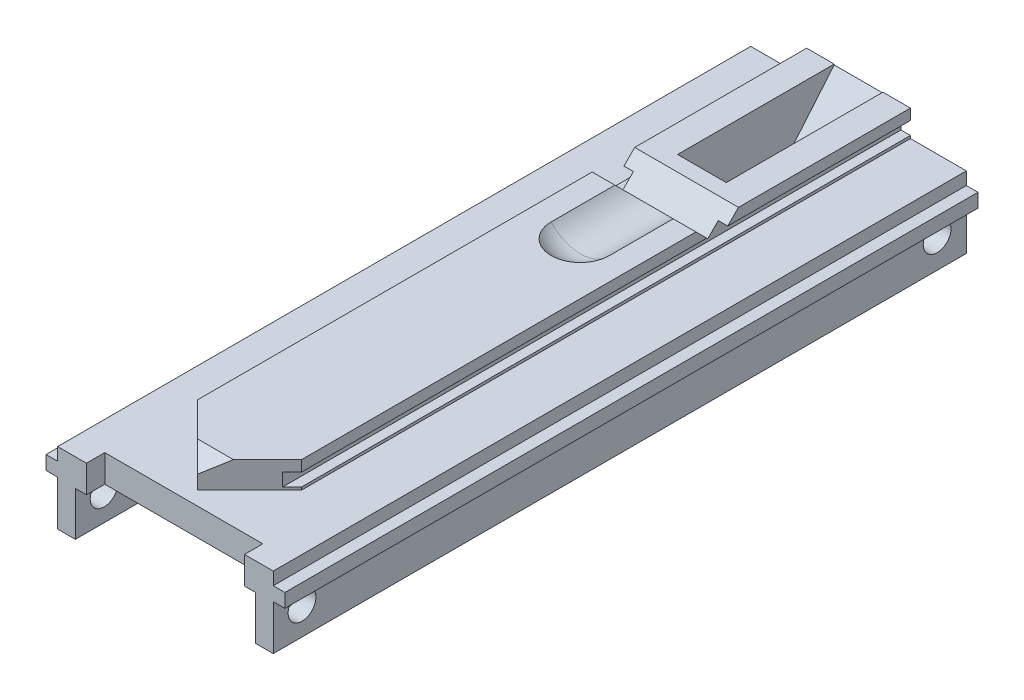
ISO-10303-21;
HEADER;
FILE_DESCRIPTION(('STEP AP214'),'2;1');
FILE_NAME('part.step','',(''),(''),'','','');
FILE_SCHEMA(('AUTOMOTIVE_DESIGN { 1 0 10303 214 1 1 1 1 }'));
ENDSEC;
DATA;
#1=APPLICATION_CONTEXT('core data for automotive mechanical design processes');
#2=APPLICATION_PROTOCOL_DEFINITION('international standard','automotive_design',2000,#1);
#3=PRODUCT_CONTEXT('',#1,'mechanical');
#4=PRODUCT('Part','Part','',(#3));
#5=PRODUCT_RELATED_PRODUCT_CATEGORY('part','',(#4));
#6=PRODUCT_DEFINITION_FORMATION('','',#4);
#7=PRODUCT_DEFINITION_CONTEXT('part definition',#1,'design');
#8=PRODUCT_DEFINITION('design','',#6,#7);
#9=PRODUCT_DEFINITION_SHAPE('','',#8);
#10=(LENGTH_UNIT() NAMED_UNIT(*) SI_UNIT(.MILLI.,.METRE.));
#11=(NAMED_UNIT(*) PLANE_ANGLE_UNIT() SI_UNIT($,.RADIAN.));
#12=(NAMED_UNIT(*) SI_UNIT($,.STERADIAN.) SOLID_ANGLE_UNIT());
#13=UNCERTAINTY_MEASURE_WITH_UNIT(LENGTH_MEASURE(1.E-05),#10,'distance_accuracy_value','');
#14=(GEOMETRIC_REPRESENTATION_CONTEXT(3) GLOBAL_UNCERTAINTY_ASSIGNED_CONTEXT((#13)) GLOBAL_UNIT_ASSIGNED_CONTEXT((#10,
#11,#12)) REPRESENTATION_CONTEXT('',''));
#15=CARTESIAN_POINT('',(0.,0.,0.));
#16=DIRECTION('',(0.,0.,1.));
#17=DIRECTION('',(1.,0.,0.));
#18=AXIS2_PLACEMENT_3D('',#15,#16,#17);
#19=CARTESIAN_POINT('',(-16.4465,-33.2232,30.6639252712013));
#20=DIRECTION('',(1.,0.,0.));
#21=DIRECTION('',(0.,0.,-1.));
#22=AXIS2_PLACEMENT_3D('',#19,#20,#21);
#23=CYLINDRICAL_SURFACE('',#22,41.275);
#24=CARTESIAN_POINT('',(-6.223,5.8621857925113,17.399));
#25=CARTESIAN_POINT('',(-6.22301261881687,5.79863423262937,17.211700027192));
#26=CARTESIAN_POINT('',(-6.21454505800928,5.73371749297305,17.0248875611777));
#27=CARTESIAN_POINT('',(-6.18100075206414,5.60171806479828,16.6535767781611));
#28=CARTESIAN_POINT('',(-6.15592773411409,5.53463586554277,16.4690779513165));
#29=CARTESIAN_POINT('',(-6.08954381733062,5.39888270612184,16.1037608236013));
#30=CARTESIAN_POINT('',(-6.04824292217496,5.3302127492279,15.9229403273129));
#31=CARTESIAN_POINT('',(-5.94981437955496,5.19185477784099,15.5660512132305));
#32=CARTESIAN_POINT('',(-5.89268596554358,5.12216671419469,15.3899828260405));
#33=CARTESIAN_POINT('',(-5.76308437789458,4.98247717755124,15.0438524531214));
#34=CARTESIAN_POINT('',(-5.690620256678,4.91247591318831,14.8737869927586));
#35=CARTESIAN_POINT('',(-5.53076856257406,4.77280598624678,14.5405944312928));
#36=CARTESIAN_POINT('',(-5.44337587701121,4.70313744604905,14.3774697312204));
#37=CARTESIAN_POINT('',(-5.25416620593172,4.56491272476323,14.0592796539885));
#38=CARTESIAN_POINT('',(-5.15234745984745,4.49635668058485,13.9042152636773));
#39=CARTESIAN_POINT('',(-4.9348245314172,4.36118830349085,13.6032513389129));
#40=CARTESIAN_POINT('',(-4.81912090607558,4.29457589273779,13.4573514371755));
#41=CARTESIAN_POINT('',(-4.57370277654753,4.16379695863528,13.1750022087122));
#42=CARTESIAN_POINT('',(-4.44391223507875,4.09964652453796,13.038611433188));
#43=CARTESIAN_POINT('',(-4.17158563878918,3.97517063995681,12.777400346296));
#44=CARTESIAN_POINT('',(-4.02905490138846,3.91484361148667,12.6525752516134));
#45=CARTESIAN_POINT('',(-3.73199153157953,3.79898829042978,12.4156213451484));
#46=CARTESIAN_POINT('',(-3.57745967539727,3.74345968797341,12.3034917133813));
#47=CARTESIAN_POINT('',(-3.2573348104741,3.63823415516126,12.0931381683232));
#48=CARTESIAN_POINT('',(-3.0917428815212,3.58853665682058,11.99491290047));
#49=CARTESIAN_POINT('',(-2.76292066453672,3.49933769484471,11.8200991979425));
#50=CARTESIAN_POINT('',(-2.60037666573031,3.45936004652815,11.7424628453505));
#51=CARTESIAN_POINT('',(-2.26788069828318,3.3861234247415,11.6011499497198));
#52=CARTESIAN_POINT('',(-2.09792974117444,3.35286353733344,11.5374715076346));
#53=CARTESIAN_POINT('',(-1.75206809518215,3.29381362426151,11.4249705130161));
#54=CARTESIAN_POINT('',(-1.576162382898,3.26801752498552,11.3761358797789));
#55=CARTESIAN_POINT('',(-1.21979222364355,3.22447547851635,11.2939807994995));
#56=CARTESIAN_POINT('',(-1.03932832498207,3.20672856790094,11.2606584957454));
#57=CARTESIAN_POINT('',(-0.696142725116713,3.18125670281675,11.2129151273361));
#58=CARTESIAN_POINT('',(-0.533724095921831,3.17262494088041,11.1967819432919));
#59=CARTESIAN_POINT('',(-0.20790701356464,3.16221610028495,11.1773338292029));
#60=CARTESIAN_POINT('',(-0.04450863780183,3.16043848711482,11.1740178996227));
#61=CARTESIAN_POINT('',(0.281929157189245,3.16377446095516,11.1802468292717));
#62=CARTESIAN_POINT('',(0.44496865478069,3.16888635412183,11.1897885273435));
#63=CARTESIAN_POINT('',(0.769441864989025,3.18589185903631,11.2216008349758));
#64=CARTESIAN_POINT('',(0.930875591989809,3.1977854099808,11.2438713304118));
#65=CARTESIAN_POINT('',(1.24252684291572,3.22731766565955,11.2993618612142));
#66=CARTESIAN_POINT('',(1.39288949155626,3.24462347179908,11.3319485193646));
#67=CARTESIAN_POINT('',(1.6901400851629,3.28481055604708,11.4079486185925));
#68=CARTESIAN_POINT('',(1.83702689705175,3.30769362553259,11.4513655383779));
#69=CARTESIAN_POINT('',(2.12635609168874,3.35864689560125,11.5485621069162));
#70=CARTESIAN_POINT('',(2.2687995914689,3.38671578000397,11.6023391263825));
#71=CARTESIAN_POINT('',(2.54855460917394,3.44762048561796,11.7197724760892));
#72=CARTESIAN_POINT('',(2.68586414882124,3.4804581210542,11.7834325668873));
#73=CARTESIAN_POINT('',(2.96135606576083,3.55217772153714,11.923495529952));
#74=CARTESIAN_POINT('',(3.09923828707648,3.59127992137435,12.0003766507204));
#75=CARTESIAN_POINT('',(3.3678967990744,3.67365411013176,12.163758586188));
#76=CARTESIAN_POINT('',(3.49867045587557,3.71692762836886,12.2502629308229));
#77=CARTESIAN_POINT('',(3.87940038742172,3.85214303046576,12.5232061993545));
#78=CARTESIAN_POINT('',(4.11793659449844,3.94952523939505,12.7231630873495));
#79=CARTESIAN_POINT('',(4.58372409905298,4.16497558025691,13.1762357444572));
#80=CARTESIAN_POINT('',(4.80715231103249,4.28414212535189,13.4327301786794));
#81=CARTESIAN_POINT('',(5.20845625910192,4.52931029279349,13.9767313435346));
#82=CARTESIAN_POINT('',(5.38629473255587,4.65531740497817,14.2642631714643));
#83=CARTESIAN_POINT('',(5.62300012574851,4.851226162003,14.7266970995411));
#84=CARTESIAN_POINT('',(5.69915894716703,4.92053758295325,14.8932390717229));
#85=CARTESIAN_POINT('',(5.83653103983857,5.05901173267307,15.2324197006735));
#86=CARTESIAN_POINT('',(5.89774894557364,5.12817450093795,15.405056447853));
#87=CARTESIAN_POINT('',(6.00474019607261,5.26561486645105,15.7551326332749));
#88=CARTESIAN_POINT('',(6.05053110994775,5.33389338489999,15.9325663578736));
#89=CARTESIAN_POINT('',(6.12634724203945,5.46901887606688,16.2912250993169));
#90=CARTESIAN_POINT('',(6.1563803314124,5.53586654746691,16.4724481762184));
#91=CARTESIAN_POINT('',(6.1931935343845,5.64616462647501,16.778131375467));
#92=CARTESIAN_POINT('',(6.20435937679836,5.69015428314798,16.9018853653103));
#93=CARTESIAN_POINT('',(6.21925760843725,5.77702168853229,17.1500201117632));
#94=CARTESIAN_POINT('',(6.2230010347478,5.81990099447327,17.2743996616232));
#95=CARTESIAN_POINT('',(6.22300000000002,5.8621857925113,17.399));
#96=B_SPLINE_CURVE_WITH_KNOTS('',3,(#24,#25,#26,#27,#28,#29,#30,#31,#32,#33,#34,#35,#36,#37,#38,
#39,#40,#41,#42,#43,#44,#45,#46,#47,#48,#49,#50,#51,#52,#53,#54,#55,#56,#57,#58,#59,#60,#61,#62,
#63,#64,#65,#66,#67,#68,#69,#70,#71,#72,#73,#74,#75,#76,#77,#78,#79,#80,#81,#82,#83,#84,#85,#86,
#87,#88,#89,#90,#91,#92,#93,#94,#95),.UNSPECIFIED.,.F.,.F.,(4,2,2,2,2,2,2,2,2,2,2,2,2,2,2,2,2,2,
2,2,2,2,2,2,2,2,2,2,2,2,2,2,2,2,2,4),(0.,0.59314461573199,1.18615614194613,1.77880267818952,
2.3714779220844,2.96380429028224,3.55633392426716,4.14893593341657,4.74151417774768,
5.33746705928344,5.93317235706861,6.52883915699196,7.1244478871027,7.677231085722,
8.22993902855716,8.78219593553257,9.33438672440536,9.82409386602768,10.313762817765,
10.8033114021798,11.2928555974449,11.7568040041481,12.220901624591,12.6848816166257,
13.149038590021,13.636422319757,14.1239854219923,15.0985254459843,16.1755240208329,
17.2534000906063,17.8402617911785,18.4269412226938,19.0129502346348,19.5986662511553,
19.9939055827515,20.3885567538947),.UNSPECIFIED.);
#97=CARTESIAN_POINT('',(4.445,4.10181929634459,13.0438072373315));
#98=VERTEX_POINT('',#97);
#99=CARTESIAN_POINT('',(6.223,5.8621857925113,17.399));
#100=VERTEX_POINT('',#99);
#101=EDGE_CURVE('E397',#98,#100,#96,.T.);
#102=ORIENTED_EDGE('',*,*,#101,.F.);
#103=CARTESIAN_POINT('',(4.445,-33.2232,30.6639252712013));
#104=DIRECTION('',(-1.,0.,0.));
#105=DIRECTION('',(0.,0.,1.));
#106=AXIS2_PLACEMENT_3D('',#103,#104,#105);
#107=CIRCLE('',#106,41.275);
#108=CARTESIAN_POINT('',(4.445,0.,6.1722));
#109=VERTEX_POINT('',#108);
#110=EDGE_CURVE('E494',#109,#98,#107,.F.);
#111=ORIENTED_EDGE('',*,*,#110,.F.);
#112=DIRECTION('',(1.,0.,0.));
#113=VECTOR('',#112,1.);
#114=CARTESIAN_POINT('',(-16.4465,0.,6.1722));
#115=LINE('',#114,#113);
#116=CARTESIAN_POINT('',(16.4465,0.,6.1722));
#117=VERTEX_POINT('',#116);
#118=EDGE_CURVE('E598',#109,#117,#115,.T.);
#119=ORIENTED_EDGE('',*,*,#118,.T.);
#120=CARTESIAN_POINT('',(16.4465,-33.2232,30.6639252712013));
#121=DIRECTION('',(1.,0.,0.));
#122=DIRECTION('',(0.,0.,-1.));
#123=AXIS2_PLACEMENT_3D('',#120,#121,#122);
#124=CIRCLE('',#123,41.275);
#125=CARTESIAN_POINT('',(16.4465,8.05179999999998,30.6639252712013));
#126=VERTEX_POINT('',#125);
#127=EDGE_CURVE('E570',#117,#126,#124,.T.);
#128=ORIENTED_EDGE('',*,*,#127,.T.);
#129=DIRECTION('',(1.,0.,0.));
#130=VECTOR('',#129,1.);
#131=CARTESIAN_POINT('',(-16.4465,8.05179999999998,30.6639252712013));
#132=LINE('',#131,#130);
#133=CARTESIAN_POINT('',(6.223,8.05179999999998,30.6639252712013));
#134=VERTEX_POINT('',#133);
#135=EDGE_CURVE('E583',#134,#126,#132,.T.);
#136=ORIENTED_EDGE('',*,*,#135,.F.);
#137=CARTESIAN_POINT('',(6.223,-33.2232,30.6639252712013));
#138=DIRECTION('',(-1.,0.,0.));
#139=DIRECTION('',(0.,0.,1.));
#140=AXIS2_PLACEMENT_3D('',#137,#138,#139);
#141=CIRCLE('',#140,41.275);
#142=EDGE_CURVE('E414',#100,#134,#141,.F.);
#143=ORIENTED_EDGE('',*,*,#142,.F.);
#144=EDGE_LOOP('',(#102,#111,#119,#128,#136,#143));
#145=FACE_BOUND('',#144,.T.);
#146=ADVANCED_FACE('F37',(#145),#23,.F.);
#147=CARTESIAN_POINT('',(-6.223,5.8621857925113,17.399));
#148=VERTEX_POINT('',#147);
#149=CARTESIAN_POINT('',(-4.445,4.10181929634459,13.0438072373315));
#150=VERTEX_POINT('',#149);
#151=EDGE_CURVE('E430',#148,#150,#96,.T.);
#152=ORIENTED_EDGE('',*,*,#151,.F.);
#153=CARTESIAN_POINT('',(-6.223,-33.2232,30.6639252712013));
#154=DIRECTION('',(1.,0.,0.));
#155=DIRECTION('',(0.,0.,-1.));
#156=AXIS2_PLACEMENT_3D('',#153,#154,#155);
#157=CIRCLE('',#156,41.275);
#158=CARTESIAN_POINT('',(-6.223,8.05179999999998,30.6639252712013));
#159=VERTEX_POINT('',#158);
#160=EDGE_CURVE('E520',#159,#148,#157,.F.);
#161=ORIENTED_EDGE('',*,*,#160,.F.);
#162=CARTESIAN_POINT('',(-16.4465,8.05179999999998,30.6639252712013));
#163=VERTEX_POINT('',#162);
#164=EDGE_CURVE('E603',#163,#159,#132,.T.);
#165=ORIENTED_EDGE('',*,*,#164,.F.);
#166=CARTESIAN_POINT('',(-16.4465,-33.2232,30.6639252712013));
#167=DIRECTION('',(1.,0.,0.));
#168=DIRECTION('',(0.,0.,-1.));
#169=AXIS2_PLACEMENT_3D('',#166,#167,#168);
#170=CIRCLE('',#169,41.275);
#171=CARTESIAN_POINT('',(-16.4465,0.,6.1722));
#172=VERTEX_POINT('',#171);
#173=EDGE_CURVE('E571',#172,#163,#170,.T.);
#174=ORIENTED_EDGE('',*,*,#173,.F.);
#175=CARTESIAN_POINT('',(-4.445,0.,6.17220000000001));
#176=VERTEX_POINT('',#175);
#177=EDGE_CURVE('E594',#172,#176,#115,.T.);
#178=ORIENTED_EDGE('',*,*,#177,.T.);
#179=CARTESIAN_POINT('',(-4.445,-33.2232,30.6639252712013));
#180=DIRECTION('',(-1.,0.,0.));
#181=DIRECTION('',(0.,0.,1.));
#182=AXIS2_PLACEMENT_3D('',#179,#180,#181);
#183=CIRCLE('',#182,41.275);
#184=EDGE_CURVE('E500',#176,#150,#183,.F.);
#185=ORIENTED_EDGE('',*,*,#184,.T.);
#186=EDGE_LOOP('',(#152,#161,#165,#174,#178,#185));
#187=FACE_BOUND('',#186,.T.);
#188=ADVANCED_FACE('F471',(#187),#23,.F.);
#189=CARTESIAN_POINT('',(-4.445,17.8816,28.5911452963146));
#190=DIRECTION('',(0.,-0.707106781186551,0.707106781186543));
#191=DIRECTION('',(0.,-0.707106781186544,-0.707106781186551));
#192=AXIS2_PLACEMENT_3D('',#189,#190,#191);
#193=PLANE('',#192);
#194=DIRECTION('',(0.,-0.707106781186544,-0.707106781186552));
#195=VECTOR('',#194,1.);
#196=CARTESIAN_POINT('',(4.445,17.8816,28.5911452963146));
#197=LINE('',#196,#195);
#198=CARTESIAN_POINT('',(4.445,17.8816,28.5911452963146));
#199=VERTEX_POINT('',#198);
#200=CARTESIAN_POINT('',(4.445,10.7618320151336,21.4713773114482));
#201=VERTEX_POINT('',#200);
#202=EDGE_CURVE('E551',#199,#201,#197,.T.);
#203=ORIENTED_EDGE('',*,*,#202,.T.);
#204=DIRECTION('',(1.,0.,0.));
#205=VECTOR('',#204,1.);
#206=CARTESIAN_POINT('',(-4.445,10.7618320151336,21.4713773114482));
#207=LINE('',#206,#205);
#208=CARTESIAN_POINT('',(-4.445,10.7618320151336,21.4713773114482));
#209=VERTEX_POINT('',#208);
#210=EDGE_CURVE('E58',#201,#209,#207,.F.);
#211=ORIENTED_EDGE('',*,*,#210,.T.);
#212=DIRECTION('',(0.,-0.707106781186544,-0.707106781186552));
#213=VECTOR('',#212,1.);
#214=CARTESIAN_POINT('',(-4.445,17.8816,28.5911452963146));
#215=LINE('',#214,#213);
#216=CARTESIAN_POINT('',(-4.445,17.8816,28.5911452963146));
#217=VERTEX_POINT('',#216);
#218=EDGE_CURVE('E530',#217,#209,#215,.T.);
#219=ORIENTED_EDGE('',*,*,#218,.F.);
#220=DIRECTION('',(1.,0.,0.));
#221=VECTOR('',#220,1.);
#222=CARTESIAN_POINT('',(-4.445,17.8816,28.5911452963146));
#223=LINE('',#222,#221);
#224=EDGE_CURVE('E547',#217,#199,#223,.T.);
#225=ORIENTED_EDGE('',*,*,#224,.T.);
#226=EDGE_LOOP('',(#203,#211,#219,#225));
#227=FACE_BOUND('',#226,.T.);
#228=ADVANCED_FACE('F456',(#227),#193,.F.);
#229=CARTESIAN_POINT('',(-4.445,0.,0.));
#230=DIRECTION('',(-1.,0.,0.));
#231=DIRECTION('',(0.,0.,1.));
#232=AXIS2_PLACEMENT_3D('',#229,#230,#231);
#233=PLANE('',#232);
#234=DIRECTION('',(0.,1.,0.));
#235=VECTOR('',#234,1.);
#236=CARTESIAN_POINT('',(-4.445,0.,13.0438072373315));
#237=LINE('',#236,#235);
#238=CARTESIAN_POINT('',(-4.445,8.05179999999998,13.0438072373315));
#239=VERTEX_POINT('',#238);
#240=EDGE_CURVE('E429',#150,#239,#237,.T.);
#241=ORIENTED_EDGE('',*,*,#240,.F.);
#242=ORIENTED_EDGE('',*,*,#184,.F.);
#243=DIRECTION('',(0.,0.,-1.));
#244=VECTOR('',#243,1.);
#245=CARTESIAN_POINT('',(-4.445,0.,10.7095452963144));
#246=LINE('',#245,#244);
#247=CARTESIAN_POINT('',(-4.445,0.,3.03536436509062));
#248=VERTEX_POINT('',#247);
#249=EDGE_CURVE('E534',#176,#248,#246,.T.);
#250=ORIENTED_EDGE('',*,*,#249,.T.);
#251=DIRECTION('',(0.,0.573576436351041,0.819152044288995));
#252=VECTOR('',#251,1.);
#253=CARTESIAN_POINT('',(-4.445,0.,3.03536436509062));
#254=LINE('',#253,#252);
#255=CARTESIAN_POINT('',(-4.445,5.22772487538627,10.5013292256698));
#256=VERTEX_POINT('',#255);
#257=EDGE_CURVE('E536',#248,#256,#254,.T.);
#258=ORIENTED_EDGE('',*,*,#257,.T.);
#259=DIRECTION('',(0.,0.766044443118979,-0.642787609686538));
#260=VECTOR('',#259,1.);
#261=CARTESIAN_POINT('',(-4.445,5.22772487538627,10.5013292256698));
#262=LINE('',#261,#260);
#263=CARTESIAN_POINT('',(-4.445,17.7427217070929,0.));
#264=VERTEX_POINT('',#263);
#265=EDGE_CURVE('E544',#256,#264,#262,.T.);
#266=ORIENTED_EDGE('',*,*,#265,.T.);
#267=DIRECTION('',(0.,1.,0.));
#268=VECTOR('',#267,1.);
#269=CARTESIAN_POINT('',(-4.445,0.,0.));
#270=LINE('',#269,#268);
#271=CARTESIAN_POINT('',(-4.445,17.8816,0.));
#272=VERTEX_POINT('',#271);
#273=EDGE_CURVE('E568',#264,#272,#270,.T.);
#274=ORIENTED_EDGE('',*,*,#273,.T.);
#275=DIRECTION('',(0.,0.,1.));
#276=VECTOR('',#275,1.);
#277=CARTESIAN_POINT('',(-4.445,17.8816,-0.116532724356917));
#278=LINE('',#277,#276);
#279=EDGE_CURVE('E532',#272,#217,#278,.T.);
#280=ORIENTED_EDGE('',*,*,#279,.T.);
#281=ORIENTED_EDGE('',*,*,#218,.T.);
#282=CARTESIAN_POINT('',(-4.445,9.63929999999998,22.5939093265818));
#283=DIRECTION('',(-1.,0.,0.));
#284=DIRECTION('',(0.,0.,1.));
#285=AXIS2_PLACEMENT_3D('',#282,#283,#284);
#286=CIRCLE('',#285,1.5875);
#287=CARTESIAN_POINT('',(-4.445,8.05179999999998,22.5939093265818));
#288=VERTEX_POINT('',#287);
#289=EDGE_CURVE('E11',#209,#288,#286,.T.);
#290=ORIENTED_EDGE('',*,*,#289,.T.);
#291=DIRECTION('',(0.,0.,1.));
#292=VECTOR('',#291,1.);
#293=CARTESIAN_POINT('',(-4.445,8.05179999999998,0.));
#294=LINE('',#293,#292);
#295=EDGE_CURVE('E401',#239,#288,#294,.T.);
#296=ORIENTED_EDGE('',*,*,#295,.F.);
#297=EDGE_LOOP('',(#241,#242,#250,#258,#266,#274,#280,#281,#290,#296));
#298=FACE_BOUND('',#297,.T.);
#299=ADVANCED_FACE('F452',(#298),#233,.F.);
#300=CARTESIAN_POINT('',(4.445,0.,0.));
#301=DIRECTION('',(-1.,0.,0.));
#302=DIRECTION('',(0.,0.,1.));
#303=AXIS2_PLACEMENT_3D('',#300,#301,#302);
#304=PLANE('',#303);
#305=ORIENTED_EDGE('',*,*,#110,.T.);
#306=DIRECTION('',(0.,1.,0.));
#307=VECTOR('',#306,1.);
#308=CARTESIAN_POINT('',(4.445,0.,13.0438072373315));
#309=LINE('',#308,#307);
#310=CARTESIAN_POINT('',(4.445,8.05179999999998,13.0438072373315));
#311=VERTEX_POINT('',#310);
#312=EDGE_CURVE('E496',#98,#311,#309,.T.);
#313=ORIENTED_EDGE('',*,*,#312,.T.);
#314=DIRECTION('',(0.,0.,1.));
#315=VECTOR('',#314,1.);
#316=CARTESIAN_POINT('',(4.445,8.05179999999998,0.));
#317=LINE('',#316,#315);
#318=CARTESIAN_POINT('',(4.445,8.05179999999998,22.5939093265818));
#319=VERTEX_POINT('',#318);
#320=EDGE_CURVE('E410',#311,#319,#317,.T.);
#321=ORIENTED_EDGE('',*,*,#320,.T.);
#322=CARTESIAN_POINT('',(4.445,9.63929999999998,22.5939093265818));
#323=DIRECTION('',(-1.,0.,0.));
#324=DIRECTION('',(0.,0.,1.));
#325=AXIS2_PLACEMENT_3D('',#322,#323,#324);
#326=CIRCLE('',#325,1.5875);
#327=EDGE_CURVE('E45',#319,#201,#326,.F.);
#328=ORIENTED_EDGE('',*,*,#327,.T.);
#329=ORIENTED_EDGE('',*,*,#202,.F.);
#330=DIRECTION('',(0.,0.,1.));
#331=VECTOR('',#330,1.);
#332=CARTESIAN_POINT('',(4.445,17.8816,-0.116532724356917));
#333=LINE('',#332,#331);
#334=CARTESIAN_POINT('',(4.445,17.8816,0.));
#335=VERTEX_POINT('',#334);
#336=EDGE_CURVE('E548',#335,#199,#333,.T.);
#337=ORIENTED_EDGE('',*,*,#336,.F.);
#338=DIRECTION('',(0.,1.,0.));
#339=VECTOR('',#338,1.);
#340=CARTESIAN_POINT('',(4.445,0.,0.));
#341=LINE('',#340,#339);
#342=CARTESIAN_POINT('',(4.445,17.7427217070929,0.));
#343=VERTEX_POINT('',#342);
#344=EDGE_CURVE('E562',#343,#335,#341,.T.);
#345=ORIENTED_EDGE('',*,*,#344,.F.);
#346=DIRECTION('',(0.,0.766044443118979,-0.642787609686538));
#347=VECTOR('',#346,1.);
#348=CARTESIAN_POINT('',(4.445,5.22772487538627,10.5013292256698));
#349=LINE('',#348,#347);
#350=CARTESIAN_POINT('',(4.445,5.22772487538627,10.5013292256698));
#351=VERTEX_POINT('',#350);
#352=EDGE_CURVE('E538',#351,#343,#349,.T.);
#353=ORIENTED_EDGE('',*,*,#352,.F.);
#354=DIRECTION('',(0.,0.573576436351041,0.819152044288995));
#355=VECTOR('',#354,1.);
#356=CARTESIAN_POINT('',(4.445,0.,3.03536436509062));
#357=LINE('',#356,#355);
#358=CARTESIAN_POINT('',(4.445,0.,3.03536436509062));
#359=VERTEX_POINT('',#358);
#360=EDGE_CURVE('E555',#359,#351,#357,.T.);
#361=ORIENTED_EDGE('',*,*,#360,.F.);
#362=DIRECTION('',(0.,0.,-1.));
#363=VECTOR('',#362,1.);
#364=CARTESIAN_POINT('',(4.445,0.,10.7095452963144));
#365=LINE('',#364,#363);
#366=EDGE_CURVE('E499',#109,#359,#365,.T.);
#367=ORIENTED_EDGE('',*,*,#366,.F.);
#368=EDGE_LOOP('',(#305,#313,#321,#328,#329,#337,#345,#353,#361,#367));
#369=FACE_BOUND('',#368,.T.);
#370=ADVANCED_FACE('F455',(#369),#304,.T.);
#371=CARTESIAN_POINT('',(19.685,0.,126.5428));
#372=DIRECTION('',(0.,1.,0.));
#373=DIRECTION('',(0.,0.,1.));
#374=AXIS2_PLACEMENT_3D('',#371,#372,#373);
#375=PLANE('',#374);
#376=DIRECTION('',(1.,0.,0.));
#377=VECTOR('',#376,1.);
#378=CARTESIAN_POINT('',(-4.445,0.,3.03536436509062));
#379=LINE('',#378,#377);
#380=EDGE_CURVE('E563',#248,#359,#379,.T.);
#381=ORIENTED_EDGE('',*,*,#380,.F.);
#382=ORIENTED_EDGE('',*,*,#249,.F.);
#383=ORIENTED_EDGE('',*,*,#177,.F.);
#384=DIRECTION('',(0.,0.,-1.));
#385=VECTOR('',#384,1.);
#386=CARTESIAN_POINT('',(-16.4465,0.,6.1722));
#387=LINE('',#386,#385);
#388=CARTESIAN_POINT('',(-16.4465,0.,126.5428));
#389=VERTEX_POINT('',#388);
#390=EDGE_CURVE('E580',#389,#172,#387,.T.);
#391=ORIENTED_EDGE('',*,*,#390,.F.);
#392=DIRECTION('',(1.,0.,0.));
#393=VECTOR('',#392,1.);
#394=CARTESIAN_POINT('',(19.685,0.,126.5428));
#395=LINE('',#394,#393);
#396=CARTESIAN_POINT('',(-19.685,0.,126.5428));
#397=VERTEX_POINT('',#396);
#398=EDGE_CURVE('E707',#397,#389,#395,.T.);
#399=ORIENTED_EDGE('',*,*,#398,.F.);
#400=DIRECTION('',(0.,0.,-1.));
#401=VECTOR('',#400,1.);
#402=CARTESIAN_POINT('',(-19.685,0.,126.5428));
#403=LINE('',#402,#401);
#404=CARTESIAN_POINT('',(-19.685,0.,0.));
#405=VERTEX_POINT('',#404);
#406=EDGE_CURVE('E813',#397,#405,#403,.T.);
#407=ORIENTED_EDGE('',*,*,#406,.T.);
#408=DIRECTION('',(1.,0.,0.));
#409=VECTOR('',#408,1.);
#410=CARTESIAN_POINT('',(19.685,0.,0.));
#411=LINE('',#410,#409);
#412=CARTESIAN_POINT('',(19.685,0.,0.));
#413=VERTEX_POINT('',#412);
#414=EDGE_CURVE('E758',#405,#413,#411,.T.);
#415=ORIENTED_EDGE('',*,*,#414,.T.);
#416=DIRECTION('',(0.,0.,-1.));
#417=VECTOR('',#416,1.);
#418=CARTESIAN_POINT('',(19.685,0.,126.5428));
#419=LINE('',#418,#417);
#420=CARTESIAN_POINT('',(19.685,0.,126.5428));
#421=VERTEX_POINT('',#420);
#422=EDGE_CURVE('E810',#421,#413,#419,.T.);
#423=ORIENTED_EDGE('',*,*,#422,.F.);
#424=CARTESIAN_POINT('',(16.4465,0.,126.5428));
#425=VERTEX_POINT('',#424);
#426=EDGE_CURVE('E706',#425,#421,#395,.T.);
#427=ORIENTED_EDGE('',*,*,#426,.F.);
#428=DIRECTION('',(0.,0.,-1.));
#429=VECTOR('',#428,1.);
#430=CARTESIAN_POINT('',(16.4465,0.,6.1722));
#431=LINE('',#430,#429);
#432=EDGE_CURVE('E575',#425,#117,#431,.T.);
#433=ORIENTED_EDGE('',*,*,#432,.T.);
#434=ORIENTED_EDGE('',*,*,#118,.F.);
#435=ORIENTED_EDGE('',*,*,#366,.T.);
#436=EDGE_LOOP('',(#381,#382,#383,#391,#399,#407,#415,#423,#427,#433,#434,#435));
#437=FACE_BOUND('',#436,.T.);
#438=ADVANCED_FACE('F460',(#437),#375,.F.);
#439=CARTESIAN_POINT('',(-21.8059,5.0419,121.29008));
#440=DIRECTION('',(1.,0.,0.));
#441=DIRECTION('',(0.,0.,-1.));
#442=AXIS2_PLACEMENT_3D('',#439,#440,#441);
#443=CYLINDRICAL_SURFACE('',#442,2.54);
#444=CARTESIAN_POINT('',(-19.685,5.0419,121.29008));
#445=DIRECTION('',(1.,0.,0.));
#446=DIRECTION('',(0.,1.,0.));
#447=AXIS2_PLACEMENT_3D('',#444,#445,#446);
#448=CIRCLE('',#447,2.54);
#449=CARTESIAN_POINT('',(-19.685,7.5819,121.29008));
#450=VERTEX_POINT('',#449);
#451=EDGE_CURVE('E669',#450,#450,#448,.T.);
#452=ORIENTED_EDGE('',*,*,#451,.F.);
#453=EDGE_LOOP('',(#452));
#454=FACE_BOUND('',#453,.T.);
#455=CARTESIAN_POINT('',(-16.4465,5.0419,121.29008));
#456=DIRECTION('',(1.,0.,0.));
#457=DIRECTION('',(0.,0.,-1.));
#458=AXIS2_PLACEMENT_3D('',#455,#456,#457);
#459=CIRCLE('',#458,2.54);
#460=CARTESIAN_POINT('',(-16.4465,5.0419,118.75008));
#461=VERTEX_POINT('',#460);
#462=EDGE_CURVE('E610',#461,#461,#459,.F.);
#463=ORIENTED_EDGE('',*,*,#462,.F.);
#464=EDGE_LOOP('',(#463));
#465=FACE_BOUND('',#464,.T.);
#466=ADVANCED_FACE('F866',(#454,#465),#443,.F.);
#467=CARTESIAN_POINT('',(9.4742,17.8816,126.5428));
#468=DIRECTION('',(-1.,0.,0.));
#469=DIRECTION('',(0.,-1.,0.));
#470=AXIS2_PLACEMENT_3D('',#467,#468,#469);
#471=PLANE('',#470);
#472=DIRECTION('',(0.,0.,-1.));
#473=VECTOR('',#472,1.);
#474=CARTESIAN_POINT('',(9.4742,17.8816,126.5428));
#475=LINE('',#474,#473);
#476=CARTESIAN_POINT('',(9.4742,17.8816,111.1758));
#477=VERTEX_POINT('',#476);
#478=CARTESIAN_POINT('',(9.4742,17.8816,39.1668));
#479=VERTEX_POINT('',#478);
#480=EDGE_CURVE('E846',#477,#479,#475,.T.);
#481=ORIENTED_EDGE('',*,*,#480,.F.);
#482=DIRECTION('',(0.,1.,0.));
#483=VECTOR('',#482,1.);
#484=CARTESIAN_POINT('',(9.4742,-9.38059540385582,111.1758));
#485=LINE('',#484,#483);
#486=CARTESIAN_POINT('',(9.4742,15.91564,111.1758));
#487=VERTEX_POINT('',#486);
#488=EDGE_CURVE('E1113',#487,#477,#485,.T.);
#489=ORIENTED_EDGE('',*,*,#488,.F.);
#490=DIRECTION('',(0.,0.,-1.));
#491=VECTOR('',#490,1.);
#492=CARTESIAN_POINT('',(9.47419999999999,15.91564,126.5428));
#493=LINE('',#492,#491);
#494=CARTESIAN_POINT('',(9.47419999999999,15.91564,37.20084));
#495=VERTEX_POINT('',#494);
#496=EDGE_CURVE('E785',#487,#495,#493,.T.);
#497=ORIENTED_EDGE('',*,*,#496,.T.);
#498=DIRECTION('',(0.,0.707106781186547,0.707106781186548));
#499=VECTOR('',#498,1.);
#500=CARTESIAN_POINT('',(9.47420000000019,61.5696,82.8548000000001));
#501=LINE('',#500,#499);
#502=EDGE_CURVE('E650',#495,#479,#501,.T.);
#503=ORIENTED_EDGE('',*,*,#502,.T.);
#504=EDGE_LOOP('',(#481,#489,#497,#503));
#505=FACE_BOUND('',#504,.T.);
#506=ADVANCED_FACE('F868',(#505),#471,.F.);
#507=CARTESIAN_POINT('',(-9.4742,17.8816,126.5428));
#508=DIRECTION('',(0.,-1.,0.));
#509=DIRECTION('',(0.,0.,-1.));
#510=AXIS2_PLACEMENT_3D('',#507,#508,#509);
#511=PLANE('',#510);
#512=DIRECTION('',(1.,0.,0.));
#513=VECTOR('',#512,1.);
#514=CARTESIAN_POINT('',(-21.8059,17.8816,117.385253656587));
#515=LINE('',#514,#513);
#516=CARTESIAN_POINT('',(-3.2647463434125,17.8816,117.385253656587));
#517=VERTEX_POINT('',#516);
#518=CARTESIAN_POINT('',(3.2647463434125,17.8816,117.385253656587));
#519=VERTEX_POINT('',#518);
#520=EDGE_CURVE('E672',#517,#519,#515,.T.);
#521=ORIENTED_EDGE('',*,*,#520,.T.);
#522=DIRECTION('',(-0.707106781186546,0.,0.707106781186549));
#523=VECTOR('',#522,1.);
#524=CARTESIAN_POINT('',(9.4742,17.8816,111.1758));
#525=LINE('',#524,#523);
#526=EDGE_CURVE('E1119',#477,#519,#525,.T.);
#527=ORIENTED_EDGE('',*,*,#526,.F.);
#528=ORIENTED_EDGE('',*,*,#480,.T.);
#529=DIRECTION('',(1.,0.,0.));
#530=VECTOR('',#529,1.);
#531=CARTESIAN_POINT('',(-21.8059,17.8816,39.1668));
#532=LINE('',#531,#530);
#533=CARTESIAN_POINT('',(5.32463687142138,17.8816,39.1668));
#534=VERTEX_POINT('',#533);
#535=EDGE_CURVE('E627',#534,#479,#532,.T.);
#536=ORIENTED_EDGE('',*,*,#535,.F.);
#537=DIRECTION('',(0.,0.,1.));
#538=VECTOR('',#537,1.);
#539=CARTESIAN_POINT('',(5.32463687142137,17.8816,61.1311068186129));
#540=LINE('',#539,#538);
#541=CARTESIAN_POINT('',(5.32463687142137,17.8816,50.8));
#542=VERTEX_POINT('',#541);
#543=EDGE_CURVE('E619',#534,#542,#540,.T.);
#544=ORIENTED_EDGE('',*,*,#543,.T.);
#545=CARTESIAN_POINT('',(0.,17.8816,50.8));
#546=DIRECTION('',(0.,-1.,0.));
#547=DIRECTION('',(0.,0.,-1.));
#548=AXIS2_PLACEMENT_3D('',#545,#546,#547);
#549=CIRCLE('',#548,5.32463687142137);
#550=CARTESIAN_POINT('',(-5.32463687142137,17.8816,50.8));
#551=VERTEX_POINT('',#550);
#552=EDGE_CURVE('E507',#542,#551,#549,.T.);
#553=ORIENTED_EDGE('',*,*,#552,.T.);
#554=DIRECTION('',(0.,0.,1.));
#555=VECTOR('',#554,1.);
#556=CARTESIAN_POINT('',(-5.32463687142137,17.8816,61.1311068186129));
#557=LINE('',#556,#555);
#558=CARTESIAN_POINT('',(-5.32463687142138,17.8816,39.1668));
#559=VERTEX_POINT('',#558);
#560=EDGE_CURVE('E616',#551,#559,#557,.F.);
#561=ORIENTED_EDGE('',*,*,#560,.T.);
#562=CARTESIAN_POINT('',(-9.4742,17.8816,39.1668));
#563=VERTEX_POINT('',#562);
#564=EDGE_CURVE('E623',#563,#559,#532,.T.);
#565=ORIENTED_EDGE('',*,*,#564,.F.);
#566=DIRECTION('',(0.,0.,-1.));
#567=VECTOR('',#566,1.);
#568=CARTESIAN_POINT('',(-9.4742,17.8816,126.5428));
#569=LINE('',#568,#567);
#570=CARTESIAN_POINT('',(-9.47420000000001,17.8816,111.1758));
#571=VERTEX_POINT('',#570);
#572=EDGE_CURVE('E843',#571,#563,#569,.T.);
#573=ORIENTED_EDGE('',*,*,#572,.F.);
#574=DIRECTION('',(-0.707106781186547,0.,-0.707106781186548));
#575=VECTOR('',#574,1.);
#576=CARTESIAN_POINT('',(0.,17.8816,120.65));
#577=LINE('',#576,#575);
#578=EDGE_CURVE('E1123',#517,#571,#577,.T.);
#579=ORIENTED_EDGE('',*,*,#578,.F.);
#580=EDGE_LOOP('',(#521,#527,#528,#536,#544,#553,#561,#565,#573,#579));
#581=FACE_BOUND('',#580,.T.);
#582=ADVANCED_FACE('F876',(#581),#511,.F.);
#583=CARTESIAN_POINT('',(-9.4742,17.8816,126.5428));
#584=DIRECTION('',(1.,0.,0.));
#585=DIRECTION('',(0.,1.,0.));
#586=AXIS2_PLACEMENT_3D('',#583,#584,#585);
#587=PLANE('',#586);
#588=DIRECTION('',(0.,0.,-1.));
#589=VECTOR('',#588,1.);
#590=CARTESIAN_POINT('',(-9.47420000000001,15.91564,126.5428));
#591=LINE('',#590,#589);
#592=CARTESIAN_POINT('',(-9.47420000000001,15.91564,111.1758));
#593=VERTEX_POINT('',#592);
#594=CARTESIAN_POINT('',(-9.47420000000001,15.91564,37.20084));
#595=VERTEX_POINT('',#594);
#596=EDGE_CURVE('E840',#593,#595,#591,.T.);
#597=ORIENTED_EDGE('',*,*,#596,.F.);
#598=DIRECTION('',(0.,1.,0.));
#599=VECTOR('',#598,1.);
#600=CARTESIAN_POINT('',(-9.47420000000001,-9.38059540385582,111.1758));
#601=LINE('',#600,#599);
#602=EDGE_CURVE('E1128',#593,#571,#601,.T.);
#603=ORIENTED_EDGE('',*,*,#602,.T.);
#604=ORIENTED_EDGE('',*,*,#572,.T.);
#605=DIRECTION('',(0.,-0.707106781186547,-0.707106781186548));
#606=VECTOR('',#605,1.);
#607=CARTESIAN_POINT('',(-9.47419999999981,61.5696,82.8548000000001));
#608=LINE('',#607,#606);
#609=EDGE_CURVE('E659',#563,#595,#608,.T.);
#610=ORIENTED_EDGE('',*,*,#609,.T.);
#611=EDGE_LOOP('',(#597,#603,#604,#610));
#612=FACE_BOUND('',#611,.T.);
#613=ADVANCED_FACE('F1071',(#612),#587,.F.);
#614=CARTESIAN_POINT('',(-9.47420000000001,15.91564,126.5428));
#615=DIRECTION('',(0.,1.,0.));
#616=DIRECTION('',(0.,0.,1.));
#617=AXIS2_PLACEMENT_3D('',#614,#615,#616);
#618=PLANE('',#617);
#619=DIRECTION('',(0.,0.,-1.));
#620=VECTOR('',#619,1.);
#621=CARTESIAN_POINT('',(-7.74700000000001,15.91564,126.5428));
#622=LINE('',#621,#620);
#623=CARTESIAN_POINT('',(-7.74700000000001,15.91564,112.903));
#624=VERTEX_POINT('',#623);
#625=CARTESIAN_POINT('',(-7.74700000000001,15.91564,37.20084));
#626=VERTEX_POINT('',#625);
#627=EDGE_CURVE('E837',#624,#626,#622,.T.);
#628=ORIENTED_EDGE('',*,*,#627,.F.);
#629=DIRECTION('',(-0.707106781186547,0.,-0.707106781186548));
#630=VECTOR('',#629,1.);
#631=CARTESIAN_POINT('',(-1.79069999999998,15.91564,118.8593));
#632=LINE('',#631,#630);
#633=EDGE_CURVE('E1138',#624,#593,#632,.T.);
#634=ORIENTED_EDGE('',*,*,#633,.T.);
#635=ORIENTED_EDGE('',*,*,#596,.T.);
#636=DIRECTION('',(1.,0.,0.));
#637=VECTOR('',#636,1.);
#638=CARTESIAN_POINT('',(-9.47420000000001,15.91564,37.20084));
#639=LINE('',#638,#637);
#640=EDGE_CURVE('E656',#595,#626,#639,.T.);
#641=ORIENTED_EDGE('',*,*,#640,.T.);
#642=EDGE_LOOP('',(#628,#634,#635,#641));
#643=FACE_BOUND('',#642,.T.);
#644=ADVANCED_FACE('F1068',(#643),#618,.F.);
#645=CARTESIAN_POINT('',(9.47419999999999,15.91564,126.5428));
#646=DIRECTION('',(0.,1.,0.));
#647=DIRECTION('',(0.,0.,1.));
#648=AXIS2_PLACEMENT_3D('',#645,#646,#647);
#649=PLANE('',#648);
#650=ORIENTED_EDGE('',*,*,#496,.F.);
#651=DIRECTION('',(-0.707106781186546,0.,0.707106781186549));
#652=VECTOR('',#651,1.);
#653=CARTESIAN_POINT('',(1.79069999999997,15.91564,118.8593));
#654=LINE('',#653,#652);
#655=CARTESIAN_POINT('',(7.74699999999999,15.91564,112.903));
#656=VERTEX_POINT('',#655);
#657=EDGE_CURVE('E552',#487,#656,#654,.T.);
#658=ORIENTED_EDGE('',*,*,#657,.T.);
#659=DIRECTION('',(0.,0.,-1.));
#660=VECTOR('',#659,1.);
#661=CARTESIAN_POINT('',(7.74699999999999,15.91564,126.5428));
#662=LINE('',#661,#660);
#663=CARTESIAN_POINT('',(7.74699999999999,15.91564,37.20084));
#664=VERTEX_POINT('',#663);
#665=EDGE_CURVE('E788',#656,#664,#662,.T.);
#666=ORIENTED_EDGE('',*,*,#665,.T.);
#667=DIRECTION('',(1.,0.,0.));
#668=VECTOR('',#667,1.);
#669=CARTESIAN_POINT('',(9.47419999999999,15.91564,37.20084));
#670=LINE('',#669,#668);
#671=EDGE_CURVE('E853',#664,#495,#670,.T.);
#672=ORIENTED_EDGE('',*,*,#671,.T.);
#673=EDGE_LOOP('',(#650,#658,#666,#672));
#674=FACE_BOUND('',#673,.T.);
#675=ADVANCED_FACE('F1084',(#674),#649,.F.);
#676=CARTESIAN_POINT('',(-14.4272,0.,123.19));
#677=DIRECTION('',(0.,0.,-1.));
#678=DIRECTION('',(-1.,0.,0.));
#679=AXIS2_PLACEMENT_3D('',#676,#677,#678);
#680=PLANE('',#679);
#681=DIRECTION('',(0.,1.,0.));
#682=VECTOR('',#681,1.);
#683=CARTESIAN_POINT('',(-14.4272,0.,123.19));
#684=LINE('',#683,#682);
#685=CARTESIAN_POINT('',(-14.4272,8.05179999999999,123.19));
#686=VERTEX_POINT('',#685);
#687=CARTESIAN_POINT('',(-14.4272,13.0556,123.19));
#688=VERTEX_POINT('',#687);
#689=EDGE_CURVE('E676',#686,#688,#684,.T.);
#690=ORIENTED_EDGE('',*,*,#689,.F.);
#691=DIRECTION('',(1.,0.,0.));
#692=VECTOR('',#691,1.);
#693=CARTESIAN_POINT('',(-14.4272,8.05179999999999,123.19));
#694=LINE('',#693,#692);
#695=CARTESIAN_POINT('',(14.4272,8.05179999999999,123.19));
#696=VERTEX_POINT('',#695);
#697=EDGE_CURVE('E606',#686,#696,#694,.T.);
#698=ORIENTED_EDGE('',*,*,#697,.T.);
#699=DIRECTION('',(0.,1.,0.));
#700=VECTOR('',#699,1.);
#701=CARTESIAN_POINT('',(14.4272,0.,123.19));
#702=LINE('',#701,#700);
#703=CARTESIAN_POINT('',(14.4272,13.0556,123.19));
#704=VERTEX_POINT('',#703);
#705=EDGE_CURVE('E679',#696,#704,#702,.T.);
#706=ORIENTED_EDGE('',*,*,#705,.T.);
#707=DIRECTION('',(1.,0.,0.));
#708=VECTOR('',#707,1.);
#709=CARTESIAN_POINT('',(9.47419999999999,13.0556,123.19));
#710=LINE('',#709,#708);
#711=EDGE_CURVE('E690',#688,#704,#710,.T.);
#712=ORIENTED_EDGE('',*,*,#711,.F.);
#713=EDGE_LOOP('',(#690,#698,#706,#712));
#714=FACE_BOUND('',#713,.T.);
#715=ADVANCED_FACE('F1078',(#714),#680,.F.);
#716=CARTESIAN_POINT('',(0.,0.,126.5428));
#717=DIRECTION('',(0.,0.,-1.));
#718=DIRECTION('',(-1.,0.,0.));
#719=AXIS2_PLACEMENT_3D('',#716,#717,#718);
#720=PLANE('',#719);
#721=DIRECTION('',(0.,-1.,0.));
#722=VECTOR('',#721,1.);
#723=CARTESIAN_POINT('',(-16.4465,0.,126.5428));
#724=LINE('',#723,#722);
#725=CARTESIAN_POINT('',(-16.4465,8.05179999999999,126.5428));
#726=VERTEX_POINT('',#725);
#727=EDGE_CURVE('E578',#726,#389,#724,.T.);
#728=ORIENTED_EDGE('',*,*,#727,.F.);
#729=DIRECTION('',(1.,0.,0.));
#730=VECTOR('',#729,1.);
#731=CARTESIAN_POINT('',(-16.4465,8.05179999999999,126.5428));
#732=LINE('',#731,#730);
#733=CARTESIAN_POINT('',(-14.4272,8.05179999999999,126.5428));
#734=VERTEX_POINT('',#733);
#735=EDGE_CURVE('E599',#726,#734,#732,.T.);
#736=ORIENTED_EDGE('',*,*,#735,.T.);
#737=DIRECTION('',(0.,1.,0.));
#738=VECTOR('',#737,1.);
#739=CARTESIAN_POINT('',(-14.4272,0.,126.5428));
#740=LINE('',#739,#738);
#741=CARTESIAN_POINT('',(-14.4272,13.0556,126.5428));
#742=VERTEX_POINT('',#741);
#743=EDGE_CURVE('E675',#734,#742,#740,.T.);
#744=ORIENTED_EDGE('',*,*,#743,.T.);
#745=DIRECTION('',(-1.,0.,0.));
#746=VECTOR('',#745,1.);
#747=CARTESIAN_POINT('',(-9.47420000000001,13.0556,126.5428));
#748=LINE('',#747,#746);
#749=CARTESIAN_POINT('',(-19.685,13.0556,126.5428));
#750=VERTEX_POINT('',#749);
#751=EDGE_CURVE('E693',#742,#750,#748,.T.);
#752=ORIENTED_EDGE('',*,*,#751,.T.);
#753=DIRECTION('',(0.,-1.,0.));
#754=VECTOR('',#753,1.);
#755=CARTESIAN_POINT('',(-19.685,13.0556,126.5428));
#756=LINE('',#755,#754);
#757=CARTESIAN_POINT('',(-19.685,10.73404,126.5428));
#758=VERTEX_POINT('',#757);
#759=EDGE_CURVE('E695',#750,#758,#756,.T.);
#760=ORIENTED_EDGE('',*,*,#759,.T.);
#761=DIRECTION('',(-1.,0.,0.));
#762=VECTOR('',#761,1.);
#763=CARTESIAN_POINT('',(-19.685,10.73404,126.5428));
#764=LINE('',#763,#762);
#765=CARTESIAN_POINT('',(-21.8059,10.73404,126.5428));
#766=VERTEX_POINT('',#765);
#767=EDGE_CURVE('E698',#758,#766,#764,.T.);
#768=ORIENTED_EDGE('',*,*,#767,.T.);
#769=DIRECTION('',(0.,-1.,0.));
#770=VECTOR('',#769,1.);
#771=CARTESIAN_POINT('',(-21.8059,10.73404,126.5428));
#772=LINE('',#771,#770);
#773=CARTESIAN_POINT('',(-21.8059,8.21943999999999,126.5428));
#774=VERTEX_POINT('',#773);
#775=EDGE_CURVE('E700',#766,#774,#772,.T.);
#776=ORIENTED_EDGE('',*,*,#775,.T.);
#777=DIRECTION('',(1.,0.,0.));
#778=VECTOR('',#777,1.);
#779=CARTESIAN_POINT('',(-21.8059,8.21943999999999,126.5428));
#780=LINE('',#779,#778);
#781=CARTESIAN_POINT('',(-19.685,8.21943999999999,126.5428));
#782=VERTEX_POINT('',#781);
#783=EDGE_CURVE('E702',#774,#782,#780,.T.);
#784=ORIENTED_EDGE('',*,*,#783,.T.);
#785=DIRECTION('',(0.,-1.,0.));
#786=VECTOR('',#785,1.);
#787=CARTESIAN_POINT('',(-19.685,8.21943999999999,126.5428));
#788=LINE('',#787,#786);
#789=EDGE_CURVE('E704',#782,#397,#788,.T.);
#790=ORIENTED_EDGE('',*,*,#789,.T.);
#791=ORIENTED_EDGE('',*,*,#398,.T.);
#792=EDGE_LOOP('',(#728,#736,#744,#752,#760,#768,#776,#784,#790,#791));
#793=FACE_BOUND('',#792,.T.);
#794=ADVANCED_FACE('F1074',(#793),#720,.F.);
#795=CARTESIAN_POINT('',(9.4742,17.8816,31.3944));
#796=VERTEX_POINT('',#795);
#797=CARTESIAN_POINT('',(9.4742,17.8816,0.));
#798=VERTEX_POINT('',#797);
#799=EDGE_CURVE('E845',#796,#798,#475,.T.);
#800=ORIENTED_EDGE('',*,*,#799,.F.);
#801=DIRECTION('',(0.,-0.707106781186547,0.707106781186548));
#802=VECTOR('',#801,1.);
#803=CARTESIAN_POINT('',(9.47419999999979,-29.6926,78.9686000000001));
#804=LINE('',#803,#802);
#805=CARTESIAN_POINT('',(9.47419999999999,15.91564,33.36036));
#806=VERTEX_POINT('',#805);
#807=EDGE_CURVE('E635',#796,#806,#804,.T.);
#808=ORIENTED_EDGE('',*,*,#807,.T.);
#809=CARTESIAN_POINT('',(9.47419999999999,15.91564,0.));
#810=VERTEX_POINT('',#809);
#811=EDGE_CURVE('E723',#806,#810,#493,.T.);
#812=ORIENTED_EDGE('',*,*,#811,.T.);
#813=DIRECTION('',(0.,1.,0.));
#814=VECTOR('',#813,1.);
#815=CARTESIAN_POINT('',(9.4742,17.8816,0.));
#816=LINE('',#815,#814);
#817=EDGE_CURVE('E692',#810,#798,#816,.T.);
#818=ORIENTED_EDGE('',*,*,#817,.T.);
#819=EDGE_LOOP('',(#800,#808,#812,#818));
#820=FACE_BOUND('',#819,.T.);
#821=ADVANCED_FACE('F878',(#820),#471,.F.);
#822=ORIENTED_EDGE('',*,*,#224,.F.);
#823=ORIENTED_EDGE('',*,*,#279,.F.);
#824=DIRECTION('',(-1.,0.,0.));
#825=VECTOR('',#824,1.);
#826=CARTESIAN_POINT('',(-9.4742,17.8816,0.));
#827=LINE('',#826,#825);
#828=CARTESIAN_POINT('',(-9.4742,17.8816,0.));
#829=VERTEX_POINT('',#828);
#830=EDGE_CURVE('E726',#272,#829,#827,.T.);
#831=ORIENTED_EDGE('',*,*,#830,.T.);
#832=CARTESIAN_POINT('',(-9.47420000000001,17.8816,31.3944));
#833=VERTEX_POINT('',#832);
#834=EDGE_CURVE('E842',#833,#829,#569,.T.);
#835=ORIENTED_EDGE('',*,*,#834,.F.);
#836=DIRECTION('',(1.,0.,0.));
#837=VECTOR('',#836,1.);
#838=CARTESIAN_POINT('',(-21.8059,17.8816,31.3944));
#839=LINE('',#838,#837);
#840=EDGE_CURVE('E628',#833,#796,#839,.T.);
#841=ORIENTED_EDGE('',*,*,#840,.T.);
#842=ORIENTED_EDGE('',*,*,#799,.T.);
#843=EDGE_CURVE('E727',#798,#335,#827,.T.);
#844=ORIENTED_EDGE('',*,*,#843,.T.);
#845=ORIENTED_EDGE('',*,*,#336,.T.);
#846=EDGE_LOOP('',(#822,#823,#831,#835,#841,#842,#844,#845));
#847=FACE_BOUND('',#846,.T.);
#848=ADVANCED_FACE('F998',(#847),#511,.F.);
#849=CARTESIAN_POINT('',(-9.47420000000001,15.91564,33.36036));
#850=VERTEX_POINT('',#849);
#851=CARTESIAN_POINT('',(-9.47420000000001,15.91564,0.));
#852=VERTEX_POINT('',#851);
#853=EDGE_CURVE('E839',#850,#852,#591,.T.);
#854=ORIENTED_EDGE('',*,*,#853,.F.);
#855=DIRECTION('',(0.,0.707106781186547,-0.707106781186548));
#856=VECTOR('',#855,1.);
#857=CARTESIAN_POINT('',(-9.47420000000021,-29.6926,78.9686000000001));
#858=LINE('',#857,#856);
#859=EDGE_CURVE('E644',#850,#833,#858,.T.);
#860=ORIENTED_EDGE('',*,*,#859,.T.);
#861=ORIENTED_EDGE('',*,*,#834,.T.);
#862=DIRECTION('',(0.,-1.,0.));
#863=VECTOR('',#862,1.);
#864=CARTESIAN_POINT('',(-9.4742,17.8816,0.));
#865=LINE('',#864,#863);
#866=EDGE_CURVE('E730',#829,#852,#865,.T.);
#867=ORIENTED_EDGE('',*,*,#866,.T.);
#868=EDGE_LOOP('',(#854,#860,#861,#867));
#869=FACE_BOUND('',#868,.T.);
#870=ADVANCED_FACE('F995',(#869),#587,.F.);
#871=CARTESIAN_POINT('',(-7.74700000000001,15.91564,33.36036));
#872=VERTEX_POINT('',#871);
#873=CARTESIAN_POINT('',(-7.74700000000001,15.91564,0.));
#874=VERTEX_POINT('',#873);
#875=EDGE_CURVE('E836',#872,#874,#622,.T.);
#876=ORIENTED_EDGE('',*,*,#875,.F.);
#877=DIRECTION('',(-1.,0.,0.));
#878=VECTOR('',#877,1.);
#879=CARTESIAN_POINT('',(-9.47420000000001,15.91564,33.36036));
#880=LINE('',#879,#878);
#881=EDGE_CURVE('E641',#872,#850,#880,.T.);
#882=ORIENTED_EDGE('',*,*,#881,.T.);
#883=ORIENTED_EDGE('',*,*,#853,.T.);
#884=DIRECTION('',(1.,0.,0.));
#885=VECTOR('',#884,1.);
#886=CARTESIAN_POINT('',(-9.47420000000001,15.91564,0.));
#887=LINE('',#886,#885);
#888=EDGE_CURVE('E733',#852,#874,#887,.T.);
#889=ORIENTED_EDGE('',*,*,#888,.T.);
#890=EDGE_LOOP('',(#876,#882,#883,#889));
#891=FACE_BOUND('',#890,.T.);
#892=ADVANCED_FACE('F991',(#891),#618,.F.);
#893=CARTESIAN_POINT('',(-7.74700000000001,15.91564,126.5428));
#894=DIRECTION('',(1.,0.,0.));
#895=DIRECTION('',(0.,1.,0.));
#896=AXIS2_PLACEMENT_3D('',#893,#894,#895);
#897=PLANE('',#896);
#898=DIRECTION('',(0.,0.,-1.));
#899=VECTOR('',#898,1.);
#900=CARTESIAN_POINT('',(-7.74700000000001,13.55344,126.5428));
#901=LINE('',#900,#899);
#902=CARTESIAN_POINT('',(-7.74700000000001,13.55344,112.903));
#903=VERTEX_POINT('',#902);
#904=CARTESIAN_POINT('',(-7.74700000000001,13.55344,0.));
#905=VERTEX_POINT('',#904);
#906=EDGE_CURVE('E834',#903,#905,#901,.T.);
#907=ORIENTED_EDGE('',*,*,#906,.F.);
#908=DIRECTION('',(0.,1.,0.));
#909=VECTOR('',#908,1.);
#910=CARTESIAN_POINT('',(-7.74700000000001,15.91564,112.903));
#911=LINE('',#910,#909);
#912=EDGE_CURVE('E1136',#903,#624,#911,.T.);
#913=ORIENTED_EDGE('',*,*,#912,.T.);
#914=ORIENTED_EDGE('',*,*,#627,.T.);
#915=DIRECTION('',(0.,-0.707106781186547,-0.707106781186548));
#916=VECTOR('',#915,1.);
#917=CARTESIAN_POINT('',(-7.74700000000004,60.58662,81.8718200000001));
#918=LINE('',#917,#916);
#919=CARTESIAN_POINT('',(-7.74700000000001,13.9954,35.2806));
#920=VERTEX_POINT('',#919);
#921=EDGE_CURVE('E653',#626,#920,#918,.T.);
#922=ORIENTED_EDGE('',*,*,#921,.T.);
#923=DIRECTION('',(0.,0.707106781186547,-0.707106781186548));
#924=VECTOR('',#923,1.);
#925=CARTESIAN_POINT('',(-7.74699999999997,-30.67558,79.9515800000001));
#926=LINE('',#925,#924);
#927=EDGE_CURVE('E638',#920,#872,#926,.T.);
#928=ORIENTED_EDGE('',*,*,#927,.T.);
#929=ORIENTED_EDGE('',*,*,#875,.T.);
#930=DIRECTION('',(0.,-1.,0.));
#931=VECTOR('',#930,1.);
#932=CARTESIAN_POINT('',(-7.74700000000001,15.91564,0.));
#933=LINE('',#932,#931);
#934=EDGE_CURVE('E736',#874,#905,#933,.T.);
#935=ORIENTED_EDGE('',*,*,#934,.T.);
#936=EDGE_LOOP('',(#907,#913,#914,#922,#928,#929,#935));
#937=FACE_BOUND('',#936,.T.);
#938=ADVANCED_FACE('F985',(#937),#897,.F.);
#939=CARTESIAN_POINT('',(-7.74700000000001,13.55344,126.5428));
#940=DIRECTION('',(0.,-1.,0.));
#941=DIRECTION('',(1.,0.,0.));
#942=AXIS2_PLACEMENT_3D('',#939,#940,#941);
#943=PLANE('',#942);
#944=DIRECTION('',(0.,0.,-1.));
#945=VECTOR('',#944,1.);
#946=CARTESIAN_POINT('',(-9.47420000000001,13.55344,126.5428));
#947=LINE('',#946,#945);
#948=CARTESIAN_POINT('',(-9.47420000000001,13.55344,111.1758));
#949=VERTEX_POINT('',#948);
#950=CARTESIAN_POINT('',(-9.47420000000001,13.55344,0.));
#951=VERTEX_POINT('',#950);
#952=EDGE_CURVE('E832',#949,#951,#947,.T.);
#953=ORIENTED_EDGE('',*,*,#952,.F.);
#954=DIRECTION('',(0.707106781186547,0.,0.707106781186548));
#955=VECTOR('',#954,1.);
#956=CARTESIAN_POINT('',(-0.927099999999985,13.55344,119.7229));
#957=LINE('',#956,#955);
#958=EDGE_CURVE('E982',#949,#903,#957,.T.);
#959=ORIENTED_EDGE('',*,*,#958,.T.);
#960=ORIENTED_EDGE('',*,*,#906,.T.);
#961=DIRECTION('',(-1.,0.,0.));
#962=VECTOR('',#961,1.);
#963=CARTESIAN_POINT('',(-7.74700000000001,13.55344,0.));
#964=LINE('',#963,#962);
#965=EDGE_CURVE('E739',#905,#951,#964,.T.);
#966=ORIENTED_EDGE('',*,*,#965,.T.);
#967=EDGE_LOOP('',(#953,#959,#960,#966));
#968=FACE_BOUND('',#967,.T.);
#969=ADVANCED_FACE('F980',(#968),#943,.F.);
#970=CARTESIAN_POINT('',(-9.47420000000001,13.55344,126.5428));
#971=DIRECTION('',(1.,0.,0.));
#972=DIRECTION('',(0.,0.,-1.));
#973=AXIS2_PLACEMENT_3D('',#970,#971,#972);
#974=PLANE('',#973);
#975=DIRECTION('',(0.,0.,-1.));
#976=VECTOR('',#975,1.);
#977=CARTESIAN_POINT('',(-9.47420000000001,13.0556,126.5428));
#978=LINE('',#977,#976);
#979=CARTESIAN_POINT('',(-9.47420000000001,13.0556,111.1758));
#980=VERTEX_POINT('',#979);
#981=CARTESIAN_POINT('',(-9.47420000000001,13.0556,0.));
#982=VERTEX_POINT('',#981);
#983=EDGE_CURVE('E830',#980,#982,#978,.T.);
#984=ORIENTED_EDGE('',*,*,#983,.F.);
#985=EDGE_CURVE('E977',#980,#949,#601,.T.);
#986=ORIENTED_EDGE('',*,*,#985,.T.);
#987=ORIENTED_EDGE('',*,*,#952,.T.);
#988=DIRECTION('',(0.,-1.,0.));
#989=VECTOR('',#988,1.);
#990=CARTESIAN_POINT('',(-9.47420000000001,13.55344,0.));
#991=LINE('',#990,#989);
#992=EDGE_CURVE('E742',#951,#982,#991,.T.);
#993=ORIENTED_EDGE('',*,*,#992,.T.);
#994=EDGE_LOOP('',(#984,#986,#987,#993));
#995=FACE_BOUND('',#994,.T.);
#996=ADVANCED_FACE('F974',(#995),#974,.F.);
#997=CARTESIAN_POINT('',(-19.685,13.0556,126.5428));
#998=DIRECTION('',(1.,0.,0.));
#999=DIRECTION('',(0.,0.,-1.));
#1000=AXIS2_PLACEMENT_3D('',#997,#998,#999);
#1001=PLANE('',#1000);
#1002=DIRECTION('',(0.,-1.,0.));
#1003=VECTOR('',#1002,1.);
#1004=CARTESIAN_POINT('',(-19.685,13.0556,0.));
#1005=LINE('',#1004,#1003);
#1006=CARTESIAN_POINT('',(-19.685,13.0556,0.));
#1007=VERTEX_POINT('',#1006);
#1008=CARTESIAN_POINT('',(-19.685,10.73404,0.));
#1009=VERTEX_POINT('',#1008);
#1010=EDGE_CURVE('E748',#1007,#1009,#1005,.T.);
#1011=ORIENTED_EDGE('',*,*,#1010,.T.);
#1012=DIRECTION('',(0.,0.,-1.));
#1013=VECTOR('',#1012,1.);
#1014=CARTESIAN_POINT('',(-19.685,10.73404,126.5428));
#1015=LINE('',#1014,#1013);
#1016=EDGE_CURVE('E825',#758,#1009,#1015,.T.);
#1017=ORIENTED_EDGE('',*,*,#1016,.F.);
#1018=ORIENTED_EDGE('',*,*,#759,.F.);
#1019=DIRECTION('',(0.,0.,-1.));
#1020=VECTOR('',#1019,1.);
#1021=CARTESIAN_POINT('',(-19.685,13.0556,126.5428));
#1022=LINE('',#1021,#1020);
#1023=EDGE_CURVE('E828',#750,#1007,#1022,.T.);
#1024=ORIENTED_EDGE('',*,*,#1023,.T.);
#1025=EDGE_LOOP('',(#1011,#1017,#1018,#1024));
#1026=FACE_BOUND('',#1025,.T.);
#1027=ADVANCED_FACE('F963',(#1026),#1001,.F.);
#1028=CARTESIAN_POINT('',(-19.685,10.73404,126.5428));
#1029=DIRECTION('',(0.,-1.,0.));
#1030=DIRECTION('',(0.,0.,-1.));
#1031=AXIS2_PLACEMENT_3D('',#1028,#1029,#1030);
#1032=PLANE('',#1031);
#1033=DIRECTION('',(-1.,0.,0.));
#1034=VECTOR('',#1033,1.);
#1035=CARTESIAN_POINT('',(-19.685,10.73404,0.));
#1036=LINE('',#1035,#1034);
#1037=CARTESIAN_POINT('',(-21.8059,10.73404,0.));
#1038=VERTEX_POINT('',#1037);
#1039=EDGE_CURVE('E750',#1009,#1038,#1036,.T.);
#1040=ORIENTED_EDGE('',*,*,#1039,.T.);
#1041=DIRECTION('',(0.,0.,-1.));
#1042=VECTOR('',#1041,1.);
#1043=CARTESIAN_POINT('',(-21.8059,10.73404,126.5428));
#1044=LINE('',#1043,#1042);
#1045=EDGE_CURVE('E822',#766,#1038,#1044,.T.);
#1046=ORIENTED_EDGE('',*,*,#1045,.F.);
#1047=ORIENTED_EDGE('',*,*,#767,.F.);
#1048=ORIENTED_EDGE('',*,*,#1016,.T.);
#1049=EDGE_LOOP('',(#1040,#1046,#1047,#1048));
#1050=FACE_BOUND('',#1049,.T.);
#1051=ADVANCED_FACE('F958',(#1050),#1032,.F.);
#1052=CARTESIAN_POINT('',(-21.8059,10.73404,126.5428));
#1053=DIRECTION('',(1.,0.,0.));
#1054=DIRECTION('',(0.,0.,-1.));
#1055=AXIS2_PLACEMENT_3D('',#1052,#1053,#1054);
#1056=PLANE('',#1055);
#1057=DIRECTION('',(0.,-1.,0.));
#1058=VECTOR('',#1057,1.);
#1059=CARTESIAN_POINT('',(-21.8059,10.73404,0.));
#1060=LINE('',#1059,#1058);
#1061=CARTESIAN_POINT('',(-21.8059,8.21943999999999,0.));
#1062=VERTEX_POINT('',#1061);
#1063=EDGE_CURVE('E752',#1038,#1062,#1060,.T.);
#1064=ORIENTED_EDGE('',*,*,#1063,.T.);
#1065=DIRECTION('',(0.,0.,-1.));
#1066=VECTOR('',#1065,1.);
#1067=CARTESIAN_POINT('',(-21.8059,8.21943999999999,126.5428));
#1068=LINE('',#1067,#1066);
#1069=EDGE_CURVE('E819',#774,#1062,#1068,.T.);
#1070=ORIENTED_EDGE('',*,*,#1069,.F.);
#1071=ORIENTED_EDGE('',*,*,#775,.F.);
#1072=ORIENTED_EDGE('',*,*,#1045,.T.);
#1073=EDGE_LOOP('',(#1064,#1070,#1071,#1072));
#1074=FACE_BOUND('',#1073,.T.);
#1075=ADVANCED_FACE('F952',(#1074),#1056,.F.);
#1076=CARTESIAN_POINT('',(-21.8059,8.21943999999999,126.5428));
#1077=DIRECTION('',(0.,1.,0.));
#1078=DIRECTION('',(0.,0.,1.));
#1079=AXIS2_PLACEMENT_3D('',#1076,#1077,#1078);
#1080=PLANE('',#1079);
#1081=DIRECTION('',(1.,0.,0.));
#1082=VECTOR('',#1081,1.);
#1083=CARTESIAN_POINT('',(-21.8059,8.21943999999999,0.));
#1084=LINE('',#1083,#1082);
#1085=CARTESIAN_POINT('',(-19.685,8.21943999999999,0.));
#1086=VERTEX_POINT('',#1085);
#1087=EDGE_CURVE('E754',#1062,#1086,#1084,.T.);
#1088=ORIENTED_EDGE('',*,*,#1087,.T.);
#1089=DIRECTION('',(0.,0.,-1.));
#1090=VECTOR('',#1089,1.);
#1091=CARTESIAN_POINT('',(-19.685,8.21943999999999,126.5428));
#1092=LINE('',#1091,#1090);
#1093=EDGE_CURVE('E816',#782,#1086,#1092,.T.);
#1094=ORIENTED_EDGE('',*,*,#1093,.F.);
#1095=ORIENTED_EDGE('',*,*,#783,.F.);
#1096=ORIENTED_EDGE('',*,*,#1069,.T.);
#1097=EDGE_LOOP('',(#1088,#1094,#1095,#1096));
#1098=FACE_BOUND('',#1097,.T.);
#1099=ADVANCED_FACE('F948',(#1098),#1080,.F.);
#1100=CARTESIAN_POINT('',(-19.685,8.21943999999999,126.5428));
#1101=DIRECTION('',(1.,0.,0.));
#1102=DIRECTION('',(0.,1.,0.));
#1103=AXIS2_PLACEMENT_3D('',#1100,#1101,#1102);
#1104=PLANE('',#1103);
#1105=CARTESIAN_POINT('',(-19.685,5.334,5.33908));
#1106=DIRECTION('',(1.,0.,0.));
#1107=DIRECTION('',(0.,1.,0.));
#1108=AXIS2_PLACEMENT_3D('',#1105,#1106,#1107);
#1109=CIRCLE('',#1108,2.54);
#1110=CARTESIAN_POINT('',(-19.685,7.874,5.33908));
#1111=VERTEX_POINT('',#1110);
#1112=EDGE_CURVE('E663',#1111,#1111,#1109,.T.);
#1113=ORIENTED_EDGE('',*,*,#1112,.T.);
#1114=EDGE_LOOP('',(#1113));
#1115=FACE_BOUND('',#1114,.T.);
#1116=ORIENTED_EDGE('',*,*,#451,.T.);
#1117=EDGE_LOOP('',(#1116));
#1118=FACE_BOUND('',#1117,.T.);
#1119=DIRECTION('',(0.,-1.,0.));
#1120=VECTOR('',#1119,1.);
#1121=CARTESIAN_POINT('',(-19.685,8.21943999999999,0.));
#1122=LINE('',#1121,#1120);
#1123=EDGE_CURVE('E756',#1086,#405,#1122,.T.);
#1124=ORIENTED_EDGE('',*,*,#1123,.T.);
#1125=ORIENTED_EDGE('',*,*,#406,.F.);
#1126=ORIENTED_EDGE('',*,*,#789,.F.);
#1127=ORIENTED_EDGE('',*,*,#1093,.T.);
#1128=EDGE_LOOP('',(#1124,#1125,#1126,#1127));
#1129=FACE_BOUND('',#1128,.T.);
#1130=ADVANCED_FACE('F904',(#1115,#1118,#1129),#1104,.F.);
#1131=CARTESIAN_POINT('',(19.685,8.21944,126.5428));
#1132=DIRECTION('',(-1.,0.,0.));
#1133=DIRECTION('',(0.,-1.,0.));
#1134=AXIS2_PLACEMENT_3D('',#1131,#1132,#1133);
#1135=PLANE('',#1134);
#1136=CARTESIAN_POINT('',(19.685,5.334,5.33908));
#1137=DIRECTION('',(-1.,0.,0.));
#1138=DIRECTION('',(0.,-1.,0.));
#1139=AXIS2_PLACEMENT_3D('',#1136,#1137,#1138);
#1140=CIRCLE('',#1139,2.54);
#1141=CARTESIAN_POINT('',(19.685,2.794,5.33908));
#1142=VERTEX_POINT('',#1141);
#1143=EDGE_CURVE('E662',#1142,#1142,#1140,.T.);
#1144=ORIENTED_EDGE('',*,*,#1143,.T.);
#1145=EDGE_LOOP('',(#1144));
#1146=FACE_BOUND('',#1145,.T.);
#1147=CARTESIAN_POINT('',(19.685,5.0419,121.29008));
#1148=DIRECTION('',(-1.,0.,0.));
#1149=DIRECTION('',(0.,-1.,0.));
#1150=AXIS2_PLACEMENT_3D('',#1147,#1148,#1149);
#1151=CIRCLE('',#1150,2.54);
#1152=CARTESIAN_POINT('',(19.685,2.5019,121.29008));
#1153=VERTEX_POINT('',#1152);
#1154=EDGE_CURVE('E666',#1153,#1153,#1151,.T.);
#1155=ORIENTED_EDGE('',*,*,#1154,.T.);
#1156=EDGE_LOOP('',(#1155));
#1157=FACE_BOUND('',#1156,.T.);
#1158=DIRECTION('',(0.,1.,0.));
#1159=VECTOR('',#1158,1.);
#1160=CARTESIAN_POINT('',(19.685,8.21944,0.));
#1161=LINE('',#1160,#1159);
#1162=CARTESIAN_POINT('',(19.685,8.21944,0.));
#1163=VERTEX_POINT('',#1162);
#1164=EDGE_CURVE('E760',#413,#1163,#1161,.T.);
#1165=ORIENTED_EDGE('',*,*,#1164,.T.);
#1166=DIRECTION('',(0.,0.,-1.));
#1167=VECTOR('',#1166,1.);
#1168=CARTESIAN_POINT('',(19.685,8.21944,126.5428));
#1169=LINE('',#1168,#1167);
#1170=CARTESIAN_POINT('',(19.685,8.21944,126.5428));
#1171=VERTEX_POINT('',#1170);
#1172=EDGE_CURVE('E807',#1171,#1163,#1169,.T.);
#1173=ORIENTED_EDGE('',*,*,#1172,.F.);
#1174=DIRECTION('',(0.,1.,0.));
#1175=VECTOR('',#1174,1.);
#1176=CARTESIAN_POINT('',(19.685,8.21944,126.5428));
#1177=LINE('',#1176,#1175);
#1178=EDGE_CURVE('E710',#421,#1171,#1177,.T.);
#1179=ORIENTED_EDGE('',*,*,#1178,.F.);
#1180=ORIENTED_EDGE('',*,*,#422,.T.);
#1181=EDGE_LOOP('',(#1165,#1173,#1179,#1180));
#1182=FACE_BOUND('',#1181,.T.);
#1183=ADVANCED_FACE('F900',(#1146,#1157,#1182),#1135,.F.);
#1184=CARTESIAN_POINT('',(21.8059,8.21944,126.5428));
#1185=DIRECTION('',(0.,1.,0.));
#1186=DIRECTION('',(0.,0.,1.));
#1187=AXIS2_PLACEMENT_3D('',#1184,#1185,#1186);
#1188=PLANE('',#1187);
#1189=DIRECTION('',(1.,0.,0.));
#1190=VECTOR('',#1189,1.);
#1191=CARTESIAN_POINT('',(21.8059,8.21944,0.));
#1192=LINE('',#1191,#1190);
#1193=CARTESIAN_POINT('',(21.8059,8.21944,0.));
#1194=VERTEX_POINT('',#1193);
#1195=EDGE_CURVE('E762',#1163,#1194,#1192,.T.);
#1196=ORIENTED_EDGE('',*,*,#1195,.T.);
#1197=DIRECTION('',(0.,0.,-1.));
#1198=VECTOR('',#1197,1.);
#1199=CARTESIAN_POINT('',(21.8059,8.21944,126.5428));
#1200=LINE('',#1199,#1198);
#1201=CARTESIAN_POINT('',(21.8059,8.21944,126.5428));
#1202=VERTEX_POINT('',#1201);
#1203=EDGE_CURVE('E804',#1202,#1194,#1200,.T.);
#1204=ORIENTED_EDGE('',*,*,#1203,.F.);
#1205=DIRECTION('',(1.,0.,0.));
#1206=VECTOR('',#1205,1.);
#1207=CARTESIAN_POINT('',(21.8059,8.21944,126.5428));
#1208=LINE('',#1207,#1206);
#1209=EDGE_CURVE('E712',#1171,#1202,#1208,.T.);
#1210=ORIENTED_EDGE('',*,*,#1209,.F.);
#1211=ORIENTED_EDGE('',*,*,#1172,.T.);
#1212=EDGE_LOOP('',(#1196,#1204,#1210,#1211));
#1213=FACE_BOUND('',#1212,.T.);
#1214=ADVANCED_FACE('F903',(#1213),#1188,.F.);
#1215=CARTESIAN_POINT('',(21.8059,10.73404,126.5428));
#1216=DIRECTION('',(-1.,0.,0.));
#1217=DIRECTION('',(0.,0.,1.));
#1218=AXIS2_PLACEMENT_3D('',#1215,#1216,#1217);
#1219=PLANE('',#1218);
#1220=DIRECTION('',(0.,1.,0.));
#1221=VECTOR('',#1220,1.);
#1222=CARTESIAN_POINT('',(21.8059,10.73404,0.));
#1223=LINE('',#1222,#1221);
#1224=CARTESIAN_POINT('',(21.8059,10.73404,0.));
#1225=VERTEX_POINT('',#1224);
#1226=EDGE_CURVE('E764',#1194,#1225,#1223,.T.);
#1227=ORIENTED_EDGE('',*,*,#1226,.T.);
#1228=DIRECTION('',(0.,0.,-1.));
#1229=VECTOR('',#1228,1.);
#1230=CARTESIAN_POINT('',(21.8059,10.73404,126.5428));
#1231=LINE('',#1230,#1229);
#1232=CARTESIAN_POINT('',(21.8059,10.73404,126.5428));
#1233=VERTEX_POINT('',#1232);
#1234=EDGE_CURVE('E801',#1233,#1225,#1231,.T.);
#1235=ORIENTED_EDGE('',*,*,#1234,.F.);
#1236=DIRECTION('',(0.,1.,0.));
#1237=VECTOR('',#1236,1.);
#1238=CARTESIAN_POINT('',(21.8059,10.73404,126.5428));
#1239=LINE('',#1238,#1237);
#1240=EDGE_CURVE('E714',#1202,#1233,#1239,.T.);
#1241=ORIENTED_EDGE('',*,*,#1240,.F.);
#1242=ORIENTED_EDGE('',*,*,#1203,.T.);
#1243=EDGE_LOOP('',(#1227,#1235,#1241,#1242));
#1244=FACE_BOUND('',#1243,.T.);
#1245=ADVANCED_FACE('F924',(#1244),#1219,.F.);
#1246=CARTESIAN_POINT('',(19.685,10.73404,126.5428));
#1247=DIRECTION('',(0.,-1.,0.));
#1248=DIRECTION('',(0.,0.,-1.));
#1249=AXIS2_PLACEMENT_3D('',#1246,#1247,#1248);
#1250=PLANE('',#1249);
#1251=DIRECTION('',(-1.,0.,0.));
#1252=VECTOR('',#1251,1.);
#1253=CARTESIAN_POINT('',(19.685,10.73404,0.));
#1254=LINE('',#1253,#1252);
#1255=CARTESIAN_POINT('',(19.685,10.73404,0.));
#1256=VERTEX_POINT('',#1255);
#1257=EDGE_CURVE('E766',#1225,#1256,#1254,.T.);
#1258=ORIENTED_EDGE('',*,*,#1257,.T.);
#1259=DIRECTION('',(0.,0.,-1.));
#1260=VECTOR('',#1259,1.);
#1261=CARTESIAN_POINT('',(19.685,10.73404,126.5428));
#1262=LINE('',#1261,#1260);
#1263=CARTESIAN_POINT('',(19.685,10.73404,126.5428));
#1264=VERTEX_POINT('',#1263);
#1265=EDGE_CURVE('E798',#1264,#1256,#1262,.T.);
#1266=ORIENTED_EDGE('',*,*,#1265,.F.);
#1267=DIRECTION('',(-1.,0.,0.));
#1268=VECTOR('',#1267,1.);
#1269=CARTESIAN_POINT('',(19.685,10.73404,126.5428));
#1270=LINE('',#1269,#1268);
#1271=EDGE_CURVE('E716',#1233,#1264,#1270,.T.);
#1272=ORIENTED_EDGE('',*,*,#1271,.F.);
#1273=ORIENTED_EDGE('',*,*,#1234,.T.);
#1274=EDGE_LOOP('',(#1258,#1266,#1272,#1273));
#1275=FACE_BOUND('',#1274,.T.);
#1276=ADVANCED_FACE('F928',(#1275),#1250,.F.);
#1277=CARTESIAN_POINT('',(19.685,13.0556,126.5428));
#1278=DIRECTION('',(-1.,0.,0.));
#1279=DIRECTION('',(0.,0.,1.));
#1280=AXIS2_PLACEMENT_3D('',#1277,#1278,#1279);
#1281=PLANE('',#1280);
#1282=DIRECTION('',(0.,1.,0.));
#1283=VECTOR('',#1282,1.);
#1284=CARTESIAN_POINT('',(19.685,13.0556,0.));
#1285=LINE('',#1284,#1283);
#1286=CARTESIAN_POINT('',(19.685,13.0556,0.));
#1287=VERTEX_POINT('',#1286);
#1288=EDGE_CURVE('E768',#1256,#1287,#1285,.T.);
#1289=ORIENTED_EDGE('',*,*,#1288,.T.);
#1290=DIRECTION('',(0.,0.,-1.));
#1291=VECTOR('',#1290,1.);
#1292=CARTESIAN_POINT('',(19.685,13.0556,126.5428));
#1293=LINE('',#1292,#1291);
#1294=CARTESIAN_POINT('',(19.685,13.0556,126.5428));
#1295=VERTEX_POINT('',#1294);
#1296=EDGE_CURVE('E796',#1295,#1287,#1293,.T.);
#1297=ORIENTED_EDGE('',*,*,#1296,.F.);
#1298=DIRECTION('',(0.,1.,0.));
#1299=VECTOR('',#1298,1.);
#1300=CARTESIAN_POINT('',(19.685,13.0556,126.5428));
#1301=LINE('',#1300,#1299);
#1302=EDGE_CURVE('E718',#1264,#1295,#1301,.T.);
#1303=ORIENTED_EDGE('',*,*,#1302,.F.);
#1304=ORIENTED_EDGE('',*,*,#1265,.T.);
#1305=EDGE_LOOP('',(#1289,#1297,#1303,#1304));
#1306=FACE_BOUND('',#1305,.T.);
#1307=ADVANCED_FACE('F1034',(#1306),#1281,.F.);
#1308=CARTESIAN_POINT('',(9.47419999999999,13.0556,126.5428));
#1309=DIRECTION('',(0.,-1.,0.));
#1310=DIRECTION('',(0.,0.,-1.));
#1311=AXIS2_PLACEMENT_3D('',#1308,#1309,#1310);
#1312=PLANE('',#1311);
#1313=ORIENTED_EDGE('',*,*,#711,.T.);
#1314=DIRECTION('',(0.,0.,1.));
#1315=VECTOR('',#1314,1.);
#1316=CARTESIAN_POINT('',(14.4272,13.0556,126.5428));
#1317=LINE('',#1316,#1315);
#1318=CARTESIAN_POINT('',(14.4272,13.0556,126.5428));
#1319=VERTEX_POINT('',#1318);
#1320=EDGE_CURVE('E678',#704,#1319,#1317,.T.);
#1321=ORIENTED_EDGE('',*,*,#1320,.T.);
#1322=DIRECTION('',(-1.,0.,0.));
#1323=VECTOR('',#1322,1.);
#1324=CARTESIAN_POINT('',(9.47419999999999,13.0556,126.5428));
#1325=LINE('',#1324,#1323);
#1326=EDGE_CURVE('E720',#1295,#1319,#1325,.T.);
#1327=ORIENTED_EDGE('',*,*,#1326,.F.);
#1328=ORIENTED_EDGE('',*,*,#1296,.T.);
#1329=DIRECTION('',(-1.,0.,0.));
#1330=VECTOR('',#1329,1.);
#1331=CARTESIAN_POINT('',(9.47419999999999,13.0556,0.));
#1332=LINE('',#1331,#1330);
#1333=CARTESIAN_POINT('',(9.47419999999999,13.0556,0.));
#1334=VERTEX_POINT('',#1333);
#1335=EDGE_CURVE('E771',#1287,#1334,#1332,.T.);
#1336=ORIENTED_EDGE('',*,*,#1335,.T.);
#1337=DIRECTION('',(0.,0.,-1.));
#1338=VECTOR('',#1337,1.);
#1339=CARTESIAN_POINT('',(9.47419999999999,13.0556,126.5428));
#1340=LINE('',#1339,#1338);
#1341=CARTESIAN_POINT('',(9.4742,13.0556,111.1758));
#1342=VERTEX_POINT('',#1341);
#1343=EDGE_CURVE('E794',#1342,#1334,#1340,.T.);
#1344=ORIENTED_EDGE('',*,*,#1343,.F.);
#1345=DIRECTION('',(-0.707106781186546,0.,0.707106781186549));
#1346=VECTOR('',#1345,1.);
#1347=CARTESIAN_POINT('',(9.4742,13.0556,111.1758));
#1348=LINE('',#1347,#1346);
#1349=CARTESIAN_POINT('',(0.,13.0556,120.65));
#1350=VERTEX_POINT('',#1349);
#1351=EDGE_CURVE('E1130',#1342,#1350,#1348,.T.);
#1352=ORIENTED_EDGE('',*,*,#1351,.T.);
#1353=DIRECTION('',(-0.707106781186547,0.,-0.707106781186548));
#1354=VECTOR('',#1353,1.);
#1355=CARTESIAN_POINT('',(0.,13.0556,120.65));
#1356=LINE('',#1355,#1354);
#1357=EDGE_CURVE('E1126',#1350,#980,#1356,.T.);
#1358=ORIENTED_EDGE('',*,*,#1357,.T.);
#1359=ORIENTED_EDGE('',*,*,#983,.T.);
#1360=DIRECTION('',(-1.,0.,0.));
#1361=VECTOR('',#1360,1.);
#1362=CARTESIAN_POINT('',(-9.47420000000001,13.0556,0.));
#1363=LINE('',#1362,#1361);
#1364=EDGE_CURVE('E745',#982,#1007,#1363,.T.);
#1365=ORIENTED_EDGE('',*,*,#1364,.T.);
#1366=ORIENTED_EDGE('',*,*,#1023,.F.);
#1367=ORIENTED_EDGE('',*,*,#751,.F.);
#1368=DIRECTION('',(0.,0.,-1.));
#1369=VECTOR('',#1368,1.);
#1370=CARTESIAN_POINT('',(-14.4272,13.0556,126.5428));
#1371=LINE('',#1370,#1369);
#1372=EDGE_CURVE('E687',#742,#688,#1371,.T.);
#1373=ORIENTED_EDGE('',*,*,#1372,.T.);
#1374=EDGE_LOOP('',(#1313,#1321,#1327,#1328,#1336,#1344,#1352,#1358,#1359,#1365,#1366,#1367,#1373));
#1375=FACE_BOUND('',#1374,.T.);
#1376=ADVANCED_FACE('F967',(#1375),#1312,.F.);
#1377=CARTESIAN_POINT('',(9.47419999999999,13.55344,126.5428));
#1378=DIRECTION('',(-1.,0.,0.));
#1379=DIRECTION('',(0.,0.,1.));
#1380=AXIS2_PLACEMENT_3D('',#1377,#1378,#1379);
#1381=PLANE('',#1380);
#1382=DIRECTION('',(0.,0.,-1.));
#1383=VECTOR('',#1382,1.);
#1384=CARTESIAN_POINT('',(9.47419999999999,13.55344,126.5428));
#1385=LINE('',#1384,#1383);
#1386=CARTESIAN_POINT('',(9.4742,13.55344,111.1758));
#1387=VERTEX_POINT('',#1386);
#1388=CARTESIAN_POINT('',(9.47419999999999,13.55344,0.));
#1389=VERTEX_POINT('',#1388);
#1390=EDGE_CURVE('E792',#1387,#1389,#1385,.T.);
#1391=ORIENTED_EDGE('',*,*,#1390,.F.);
#1392=EDGE_CURVE('E1030',#1342,#1387,#485,.T.);
#1393=ORIENTED_EDGE('',*,*,#1392,.F.);
#1394=ORIENTED_EDGE('',*,*,#1343,.T.);
#1395=DIRECTION('',(0.,1.,0.));
#1396=VECTOR('',#1395,1.);
#1397=CARTESIAN_POINT('',(9.47419999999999,13.55344,0.));
#1398=LINE('',#1397,#1396);
#1399=EDGE_CURVE('E774',#1334,#1389,#1398,.T.);
#1400=ORIENTED_EDGE('',*,*,#1399,.T.);
#1401=EDGE_LOOP('',(#1391,#1393,#1394,#1400));
#1402=FACE_BOUND('',#1401,.T.);
#1403=ADVANCED_FACE('F1027',(#1402),#1381,.F.);
#1404=CARTESIAN_POINT('',(7.74699999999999,13.55344,126.5428));
#1405=DIRECTION('',(0.,-1.,0.));
#1406=DIRECTION('',(0.,0.,-1.));
#1407=AXIS2_PLACEMENT_3D('',#1404,#1405,#1406);
#1408=PLANE('',#1407);
#1409=DIRECTION('',(0.,0.,-1.));
#1410=VECTOR('',#1409,1.);
#1411=CARTESIAN_POINT('',(7.74699999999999,13.55344,126.5428));
#1412=LINE('',#1411,#1410);
#1413=CARTESIAN_POINT('',(7.74699999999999,13.55344,112.903));
#1414=VERTEX_POINT('',#1413);
#1415=CARTESIAN_POINT('',(7.74699999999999,13.55344,0.));
#1416=VERTEX_POINT('',#1415);
#1417=EDGE_CURVE('E790',#1414,#1416,#1412,.T.);
#1418=ORIENTED_EDGE('',*,*,#1417,.F.);
#1419=DIRECTION('',(0.707106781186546,0.,-0.707106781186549));
#1420=VECTOR('',#1419,1.);
#1421=CARTESIAN_POINT('',(0.927099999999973,13.55344,119.7229));
#1422=LINE('',#1421,#1420);
#1423=EDGE_CURVE('E1142',#1414,#1387,#1422,.T.);
#1424=ORIENTED_EDGE('',*,*,#1423,.T.);
#1425=ORIENTED_EDGE('',*,*,#1390,.T.);
#1426=DIRECTION('',(-1.,0.,0.));
#1427=VECTOR('',#1426,1.);
#1428=CARTESIAN_POINT('',(7.74699999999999,13.55344,0.));
#1429=LINE('',#1428,#1427);
#1430=EDGE_CURVE('E777',#1389,#1416,#1429,.T.);
#1431=ORIENTED_EDGE('',*,*,#1430,.T.);
#1432=EDGE_LOOP('',(#1418,#1424,#1425,#1431));
#1433=FACE_BOUND('',#1432,.T.);
#1434=ADVANCED_FACE('F1022',(#1433),#1408,.F.);
#1435=CARTESIAN_POINT('',(7.74699999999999,15.91564,126.5428));
#1436=DIRECTION('',(-1.,0.,0.));
#1437=DIRECTION('',(0.,0.,1.));
#1438=AXIS2_PLACEMENT_3D('',#1435,#1436,#1437);
#1439=PLANE('',#1438);
#1440=ORIENTED_EDGE('',*,*,#665,.F.);
#1441=DIRECTION('',(0.,-1.,0.));
#1442=VECTOR('',#1441,1.);
#1443=CARTESIAN_POINT('',(7.74699999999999,15.91564,112.903));
#1444=LINE('',#1443,#1442);
#1445=EDGE_CURVE('E1019',#656,#1414,#1444,.T.);
#1446=ORIENTED_EDGE('',*,*,#1445,.T.);
#1447=ORIENTED_EDGE('',*,*,#1417,.T.);
#1448=DIRECTION('',(0.,1.,0.));
#1449=VECTOR('',#1448,1.);
#1450=CARTESIAN_POINT('',(7.74699999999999,15.91564,0.));
#1451=LINE('',#1450,#1449);
#1452=CARTESIAN_POINT('',(7.74699999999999,15.91564,0.));
#1453=VERTEX_POINT('',#1452);
#1454=EDGE_CURVE('E780',#1416,#1453,#1451,.T.);
#1455=ORIENTED_EDGE('',*,*,#1454,.T.);
#1456=CARTESIAN_POINT('',(7.74699999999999,15.91564,33.36036));
#1457=VERTEX_POINT('',#1456);
#1458=EDGE_CURVE('E787',#1457,#1453,#662,.T.);
#1459=ORIENTED_EDGE('',*,*,#1458,.F.);
#1460=DIRECTION('',(0.,-0.707106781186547,0.707106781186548));
#1461=VECTOR('',#1460,1.);
#1462=CARTESIAN_POINT('',(7.74699999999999,-30.67558,79.9515800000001));
#1463=LINE('',#1462,#1461);
#1464=CARTESIAN_POINT('',(7.74699999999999,13.9954,35.2806));
#1465=VERTEX_POINT('',#1464);
#1466=EDGE_CURVE('E626',#1457,#1465,#1463,.T.);
#1467=ORIENTED_EDGE('',*,*,#1466,.T.);
#1468=DIRECTION('',(0.,0.707106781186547,0.707106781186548));
#1469=VECTOR('',#1468,1.);
#1470=CARTESIAN_POINT('',(7.74699999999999,60.58662,81.8718200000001));
#1471=LINE('',#1470,#1469);
#1472=EDGE_CURVE('E647',#1465,#664,#1471,.T.);
#1473=ORIENTED_EDGE('',*,*,#1472,.T.);
#1474=EDGE_LOOP('',(#1440,#1446,#1447,#1455,#1459,#1467,#1473));
#1475=FACE_BOUND('',#1474,.T.);
#1476=ADVANCED_FACE('F1016',(#1475),#1439,.F.);
#1477=ORIENTED_EDGE('',*,*,#811,.F.);
#1478=DIRECTION('',(-1.,0.,0.));
#1479=VECTOR('',#1478,1.);
#1480=CARTESIAN_POINT('',(9.47419999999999,15.91564,33.36036));
#1481=LINE('',#1480,#1479);
#1482=EDGE_CURVE('E848',#806,#1457,#1481,.T.);
#1483=ORIENTED_EDGE('',*,*,#1482,.T.);
#1484=ORIENTED_EDGE('',*,*,#1458,.T.);
#1485=DIRECTION('',(1.,0.,0.));
#1486=VECTOR('',#1485,1.);
#1487=CARTESIAN_POINT('',(9.47419999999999,15.91564,0.));
#1488=LINE('',#1487,#1486);
#1489=EDGE_CURVE('E696',#1453,#810,#1488,.T.);
#1490=ORIENTED_EDGE('',*,*,#1489,.T.);
#1491=EDGE_LOOP('',(#1477,#1483,#1484,#1490));
#1492=FACE_BOUND('',#1491,.T.);
#1493=ADVANCED_FACE('F1012',(#1492),#649,.F.);
#1494=DIRECTION('',(0.,1.,0.));
#1495=VECTOR('',#1494,1.);
#1496=CARTESIAN_POINT('',(14.4272,0.,126.5428));
#1497=LINE('',#1496,#1495);
#1498=CARTESIAN_POINT('',(14.4272,8.05179999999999,126.5428));
#1499=VERTEX_POINT('',#1498);
#1500=EDGE_CURVE('E682',#1499,#1319,#1497,.T.);
#1501=ORIENTED_EDGE('',*,*,#1500,.F.);
#1502=CARTESIAN_POINT('',(16.4465,8.05179999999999,126.5428));
#1503=VERTEX_POINT('',#1502);
#1504=EDGE_CURVE('E602',#1499,#1503,#732,.T.);
#1505=ORIENTED_EDGE('',*,*,#1504,.T.);
#1506=DIRECTION('',(0.,-1.,0.));
#1507=VECTOR('',#1506,1.);
#1508=CARTESIAN_POINT('',(16.4465,0.,126.5428));
#1509=LINE('',#1508,#1507);
#1510=EDGE_CURVE('E589',#1503,#425,#1509,.T.);
#1511=ORIENTED_EDGE('',*,*,#1510,.T.);
#1512=ORIENTED_EDGE('',*,*,#426,.T.);
#1513=ORIENTED_EDGE('',*,*,#1178,.T.);
#1514=ORIENTED_EDGE('',*,*,#1209,.T.);
#1515=ORIENTED_EDGE('',*,*,#1240,.T.);
#1516=ORIENTED_EDGE('',*,*,#1271,.T.);
#1517=ORIENTED_EDGE('',*,*,#1302,.T.);
#1518=ORIENTED_EDGE('',*,*,#1326,.T.);
#1519=EDGE_LOOP('',(#1501,#1505,#1511,#1512,#1513,#1514,#1515,#1516,#1517,#1518));
#1520=FACE_BOUND('',#1519,.T.);
#1521=ADVANCED_FACE('F933',(#1520),#720,.F.);
#1522=CARTESIAN_POINT('',(0.,0.,0.));
#1523=DIRECTION('',(0.,0.,-1.));
#1524=DIRECTION('',(-1.,0.,0.));
#1525=AXIS2_PLACEMENT_3D('',#1522,#1523,#1524);
#1526=PLANE('',#1525);
#1527=ORIENTED_EDGE('',*,*,#273,.F.);
#1528=DIRECTION('',(-1.,0.,0.));
#1529=VECTOR('',#1528,1.);
#1530=CARTESIAN_POINT('',(0.,17.7427217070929,0.));
#1531=LINE('',#1530,#1529);
#1532=EDGE_CURVE('E504',#343,#264,#1531,.T.);
#1533=ORIENTED_EDGE('',*,*,#1532,.F.);
#1534=ORIENTED_EDGE('',*,*,#344,.T.);
#1535=ORIENTED_EDGE('',*,*,#843,.F.);
#1536=ORIENTED_EDGE('',*,*,#817,.F.);
#1537=ORIENTED_EDGE('',*,*,#1489,.F.);
#1538=ORIENTED_EDGE('',*,*,#1454,.F.);
#1539=ORIENTED_EDGE('',*,*,#1430,.F.);
#1540=ORIENTED_EDGE('',*,*,#1399,.F.);
#1541=ORIENTED_EDGE('',*,*,#1335,.F.);
#1542=ORIENTED_EDGE('',*,*,#1288,.F.);
#1543=ORIENTED_EDGE('',*,*,#1257,.F.);
#1544=ORIENTED_EDGE('',*,*,#1226,.F.);
#1545=ORIENTED_EDGE('',*,*,#1195,.F.);
#1546=ORIENTED_EDGE('',*,*,#1164,.F.);
#1547=ORIENTED_EDGE('',*,*,#414,.F.);
#1548=ORIENTED_EDGE('',*,*,#1123,.F.);
#1549=ORIENTED_EDGE('',*,*,#1087,.F.);
#1550=ORIENTED_EDGE('',*,*,#1063,.F.);
#1551=ORIENTED_EDGE('',*,*,#1039,.F.);
#1552=ORIENTED_EDGE('',*,*,#1010,.F.);
#1553=ORIENTED_EDGE('',*,*,#1364,.F.);
#1554=ORIENTED_EDGE('',*,*,#992,.F.);
#1555=ORIENTED_EDGE('',*,*,#965,.F.);
#1556=ORIENTED_EDGE('',*,*,#934,.F.);
#1557=ORIENTED_EDGE('',*,*,#888,.F.);
#1558=ORIENTED_EDGE('',*,*,#866,.F.);
#1559=ORIENTED_EDGE('',*,*,#830,.F.);
#1560=EDGE_LOOP('',(#1527,#1533,#1534,#1535,#1536,#1537,#1538,#1539,#1540,#1541,#1542,#1543,
#1544,#1545,#1546,#1547,#1548,#1549,#1550,#1551,#1552,#1553,#1554,#1555,#1556,#1557,#1558,#1559));
#1561=FACE_BOUND('',#1560,.T.);
#1562=ADVANCED_FACE('F919',(#1561),#1526,.T.);
#1563=CARTESIAN_POINT('',(-14.4272,0.,126.5428));
#1564=DIRECTION('',(-1.,0.,0.));
#1565=DIRECTION('',(0.,0.,1.));
#1566=AXIS2_PLACEMENT_3D('',#1563,#1564,#1565);
#1567=PLANE('',#1566);
#1568=ORIENTED_EDGE('',*,*,#743,.F.);
#1569=DIRECTION('',(0.,0.,-1.));
#1570=VECTOR('',#1569,1.);
#1571=CARTESIAN_POINT('',(-14.4272,8.05179999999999,126.5428));
#1572=LINE('',#1571,#1570);
#1573=EDGE_CURVE('E609',#734,#686,#1572,.T.);
#1574=ORIENTED_EDGE('',*,*,#1573,.T.);
#1575=ORIENTED_EDGE('',*,*,#689,.T.);
#1576=ORIENTED_EDGE('',*,*,#1372,.F.);
#1577=EDGE_LOOP('',(#1568,#1574,#1575,#1576));
#1578=FACE_BOUND('',#1577,.T.);
#1579=ADVANCED_FACE('F1095',(#1578),#1567,.F.);
#1580=CARTESIAN_POINT('',(14.4272,0.,126.5428));
#1581=DIRECTION('',(1.,0.,0.));
#1582=DIRECTION('',(0.,0.,-1.));
#1583=AXIS2_PLACEMENT_3D('',#1580,#1581,#1582);
#1584=PLANE('',#1583);
#1585=ORIENTED_EDGE('',*,*,#705,.F.);
#1586=DIRECTION('',(0.,0.,1.));
#1587=VECTOR('',#1586,1.);
#1588=CARTESIAN_POINT('',(14.4272,8.05179999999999,126.5428));
#1589=LINE('',#1588,#1587);
#1590=EDGE_CURVE('E501',#696,#1499,#1589,.T.);
#1591=ORIENTED_EDGE('',*,*,#1590,.T.);
#1592=ORIENTED_EDGE('',*,*,#1500,.T.);
#1593=ORIENTED_EDGE('',*,*,#1320,.F.);
#1594=EDGE_LOOP('',(#1585,#1591,#1592,#1593));
#1595=FACE_BOUND('',#1594,.T.);
#1596=ADVANCED_FACE('F894',(#1595),#1584,.F.);
#1597=CARTESIAN_POINT('',(-21.8059,15.5956,120.65));
#1598=DIRECTION('',(0.,-0.819152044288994,-0.573576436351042));
#1599=DIRECTION('',(0.,0.573576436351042,-0.819152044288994));
#1600=AXIS2_PLACEMENT_3D('',#1597,#1598,#1599);
#1601=PLANE('',#1600);
#1602=DIRECTION('',(0.633687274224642,-0.443712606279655,0.633687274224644));
#1603=VECTOR('',#1602,1.);
#1604=CARTESIAN_POINT('',(-8.75636764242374,21.7268746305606,111.893632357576));
#1605=LINE('',#1604,#1603);
#1606=CARTESIAN_POINT('',(0.,15.5956,120.65));
#1607=VERTEX_POINT('',#1606);
#1608=EDGE_CURVE('E512',#517,#1607,#1605,.T.);
#1609=ORIENTED_EDGE('',*,*,#1608,.T.);
#1610=DIRECTION('',(0.633687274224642,0.443712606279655,-0.633687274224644));
#1611=VECTOR('',#1610,1.);
#1612=CARTESIAN_POINT('',(-8.75636764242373,9.46432536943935,129.406367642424));
#1613=LINE('',#1612,#1611);
#1614=EDGE_CURVE('E515',#1607,#519,#1613,.T.);
#1615=ORIENTED_EDGE('',*,*,#1614,.T.);
#1616=ORIENTED_EDGE('',*,*,#520,.F.);
#1617=EDGE_LOOP('',(#1609,#1615,#1616));
#1618=FACE_BOUND('',#1617,.T.);
#1619=ADVANCED_FACE('F886',(#1618),#1601,.F.);
#1620=CARTESIAN_POINT('',(16.4465,5.0419,121.29008));
#1621=DIRECTION('',(1.,0.,0.));
#1622=DIRECTION('',(0.,0.,-1.));
#1623=AXIS2_PLACEMENT_3D('',#1620,#1621,#1622);
#1624=CIRCLE('',#1623,2.54);
#1625=CARTESIAN_POINT('',(16.4465,5.0419,118.75008));
#1626=VERTEX_POINT('',#1625);
#1627=EDGE_CURVE('E597',#1626,#1626,#1624,.F.);
#1628=ORIENTED_EDGE('',*,*,#1627,.T.);
#1629=EDGE_LOOP('',(#1628));
#1630=FACE_BOUND('',#1629,.T.);
#1631=ORIENTED_EDGE('',*,*,#1154,.F.);
#1632=EDGE_LOOP('',(#1631));
#1633=FACE_BOUND('',#1632,.T.);
#1634=ADVANCED_FACE('F871',(#1630,#1633),#443,.F.);
#1635=CARTESIAN_POINT('',(-21.8059,5.334,5.33908));
#1636=DIRECTION('',(1.,0.,0.));
#1637=DIRECTION('',(0.,0.,-1.));
#1638=AXIS2_PLACEMENT_3D('',#1635,#1636,#1637);
#1639=CYLINDRICAL_SURFACE('',#1638,2.54);
#1640=ORIENTED_EDGE('',*,*,#1143,.F.);
#1641=EDGE_LOOP('',(#1640));
#1642=FACE_BOUND('',#1641,.T.);
#1643=ORIENTED_EDGE('',*,*,#1112,.F.);
#1644=EDGE_LOOP('',(#1643));
#1645=FACE_BOUND('',#1644,.T.);
#1646=ADVANCED_FACE('F885',(#1642,#1645),#1639,.F.);
#1647=CARTESIAN_POINT('',(-21.8059,13.9954,35.2806));
#1648=DIRECTION('',(0.,-0.707106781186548,0.707106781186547));
#1649=DIRECTION('',(0.,-0.707106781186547,-0.707106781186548));
#1650=AXIS2_PLACEMENT_3D('',#1647,#1648,#1649);
#1651=PLANE('',#1650);
#1652=ORIENTED_EDGE('',*,*,#564,.T.);
#1653=CARTESIAN_POINT('',(0.,22.6441,43.9293));
#1654=DIRECTION('',(0.,-0.707106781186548,0.707106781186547));
#1655=DIRECTION('',(0.,0.707106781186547,0.707106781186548));
#1656=AXIS2_PLACEMENT_3D('',#1653,#1654,#1655);
#1657=ELLIPSE('',#1656,10.1027881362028,7.14375);
#1658=EDGE_CURVE('E856',#559,#534,#1657,.T.);
#1659=ORIENTED_EDGE('',*,*,#1658,.T.);
#1660=ORIENTED_EDGE('',*,*,#535,.T.);
#1661=ORIENTED_EDGE('',*,*,#502,.F.);
#1662=ORIENTED_EDGE('',*,*,#671,.F.);
#1663=ORIENTED_EDGE('',*,*,#1472,.F.);
#1664=DIRECTION('',(1.,0.,0.));
#1665=VECTOR('',#1664,1.);
#1666=CARTESIAN_POINT('',(-21.8059,13.9954,35.2806));
#1667=LINE('',#1666,#1665);
#1668=EDGE_CURVE('E622',#920,#1465,#1667,.T.);
#1669=ORIENTED_EDGE('',*,*,#1668,.F.);
#1670=ORIENTED_EDGE('',*,*,#921,.F.);
#1671=ORIENTED_EDGE('',*,*,#640,.F.);
#1672=ORIENTED_EDGE('',*,*,#609,.F.);
#1673=EDGE_LOOP('',(#1652,#1659,#1660,#1661,#1662,#1663,#1669,#1670,#1671,#1672));
#1674=FACE_BOUND('',#1673,.T.);
#1675=ADVANCED_FACE('F892',(#1674),#1651,.F.);
#1676=CARTESIAN_POINT('',(-21.8059,17.8816,31.3944));
#1677=DIRECTION('',(0.,-0.707106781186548,-0.707106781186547));
#1678=DIRECTION('',(0.,0.707106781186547,-0.707106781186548));
#1679=AXIS2_PLACEMENT_3D('',#1676,#1677,#1678);
#1680=PLANE('',#1679);
#1681=ORIENTED_EDGE('',*,*,#881,.F.);
#1682=ORIENTED_EDGE('',*,*,#927,.F.);
#1683=ORIENTED_EDGE('',*,*,#1668,.T.);
#1684=ORIENTED_EDGE('',*,*,#1466,.F.);
#1685=ORIENTED_EDGE('',*,*,#1482,.F.);
#1686=ORIENTED_EDGE('',*,*,#807,.F.);
#1687=ORIENTED_EDGE('',*,*,#840,.F.);
#1688=ORIENTED_EDGE('',*,*,#859,.F.);
#1689=EDGE_LOOP('',(#1681,#1682,#1683,#1684,#1685,#1686,#1687,#1688));
#1690=FACE_BOUND('',#1689,.T.);
#1691=ADVANCED_FACE('F1157',(#1690),#1680,.F.);
#1692=CARTESIAN_POINT('',(0.,22.6441,50.8));
#1693=DIRECTION('',(0.,0.,1.));
#1694=DIRECTION('',(0.,1.,0.));
#1695=AXIS2_PLACEMENT_3D('',#1692,#1693,#1694);
#1696=SPHERICAL_SURFACE('',#1695,7.14375);
#1697=CARTESIAN_POINT('',(0.,22.6441,50.8));
#1698=DIRECTION('',(0.,0.,1.));
#1699=DIRECTION('',(1.,0.,0.));
#1700=AXIS2_PLACEMENT_3D('',#1697,#1698,#1699);
#1701=CIRCLE('',#1700,7.14375);
#1702=EDGE_CURVE('E613',#551,#542,#1701,.T.);
#1703=ORIENTED_EDGE('',*,*,#1702,.F.);
#1704=ORIENTED_EDGE('',*,*,#552,.F.);
#1705=EDGE_LOOP('',(#1703,#1704));
#1706=FACE_BOUND('',#1705,.T.);
#1707=ADVANCED_FACE('F483',(#1706),#1696,.F.);
#1708=CARTESIAN_POINT('',(0.,22.6441,61.1311068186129));
#1709=DIRECTION('',(0.,0.,1.));
#1710=DIRECTION('',(1.,0.,0.));
#1711=AXIS2_PLACEMENT_3D('',#1708,#1709,#1710);
#1712=CYLINDRICAL_SURFACE('',#1711,7.14375);
#1713=ORIENTED_EDGE('',*,*,#1658,.F.);
#1714=ORIENTED_EDGE('',*,*,#560,.F.);
#1715=ORIENTED_EDGE('',*,*,#1702,.T.);
#1716=ORIENTED_EDGE('',*,*,#543,.F.);
#1717=EDGE_LOOP('',(#1713,#1714,#1715,#1716));
#1718=FACE_BOUND('',#1717,.T.);
#1719=ADVANCED_FACE('F479',(#1718),#1712,.F.);
#1720=CARTESIAN_POINT('',(-16.4465,8.05179999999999,126.5428));
#1721=DIRECTION('',(0.,1.,0.));
#1722=DIRECTION('',(0.,0.,1.));
#1723=AXIS2_PLACEMENT_3D('',#1720,#1721,#1722);
#1724=PLANE('',#1723);
#1725=DIRECTION('',(1.,0.,0.));
#1726=VECTOR('',#1725,1.);
#1727=CARTESIAN_POINT('',(-16.4465,8.05179999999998,22.5939093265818));
#1728=LINE('',#1727,#1726);
#1729=EDGE_CURVE('E523',#288,#319,#1728,.T.);
#1730=ORIENTED_EDGE('',*,*,#1729,.T.);
#1731=ORIENTED_EDGE('',*,*,#320,.F.);
#1732=CARTESIAN_POINT('',(0.,8.05179999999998,17.399));
#1733=DIRECTION('',(0.,-1.,0.));
#1734=DIRECTION('',(0.,0.,-1.));
#1735=AXIS2_PLACEMENT_3D('',#1732,#1733,#1734);
#1736=CIRCLE('',#1735,6.223);
#1737=CARTESIAN_POINT('',(6.223,8.05179999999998,17.399));
#1738=VERTEX_POINT('',#1737);
#1739=EDGE_CURVE('E394',#311,#1738,#1736,.T.);
#1740=ORIENTED_EDGE('',*,*,#1739,.T.);
#1741=DIRECTION('',(0.,0.,1.));
#1742=VECTOR('',#1741,1.);
#1743=CARTESIAN_POINT('',(6.223,8.05179999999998,17.399));
#1744=LINE('',#1743,#1742);
#1745=EDGE_CURVE('E408',#1738,#134,#1744,.T.);
#1746=ORIENTED_EDGE('',*,*,#1745,.T.);
#1747=ORIENTED_EDGE('',*,*,#135,.T.);
#1748=DIRECTION('',(0.,0.,1.));
#1749=VECTOR('',#1748,1.);
#1750=CARTESIAN_POINT('',(16.4465,8.05179999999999,126.5428));
#1751=LINE('',#1750,#1749);
#1752=EDGE_CURVE('E586',#126,#1503,#1751,.T.);
#1753=ORIENTED_EDGE('',*,*,#1752,.T.);
#1754=ORIENTED_EDGE('',*,*,#1504,.F.);
#1755=ORIENTED_EDGE('',*,*,#1590,.F.);
#1756=ORIENTED_EDGE('',*,*,#697,.F.);
#1757=ORIENTED_EDGE('',*,*,#1573,.F.);
#1758=ORIENTED_EDGE('',*,*,#735,.F.);
#1759=DIRECTION('',(0.,0.,1.));
#1760=VECTOR('',#1759,1.);
#1761=CARTESIAN_POINT('',(-16.4465,8.05179999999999,126.5428));
#1762=LINE('',#1761,#1760);
#1763=EDGE_CURVE('E574',#163,#726,#1762,.T.);
#1764=ORIENTED_EDGE('',*,*,#1763,.F.);
#1765=ORIENTED_EDGE('',*,*,#164,.T.);
#1766=DIRECTION('',(0.,0.,-1.));
#1767=VECTOR('',#1766,1.);
#1768=CARTESIAN_POINT('',(-6.223,8.05179999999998,17.399));
#1769=LINE('',#1768,#1767);
#1770=CARTESIAN_POINT('',(-6.223,8.05179999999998,17.399));
#1771=VERTEX_POINT('',#1770);
#1772=EDGE_CURVE('E415',#159,#1771,#1769,.T.);
#1773=ORIENTED_EDGE('',*,*,#1772,.T.);
#1774=EDGE_CURVE('E411',#1771,#239,#1736,.T.);
#1775=ORIENTED_EDGE('',*,*,#1774,.T.);
#1776=ORIENTED_EDGE('',*,*,#295,.T.);
#1777=EDGE_LOOP('',(#1730,#1731,#1740,#1746,#1747,#1753,#1754,#1755,#1756,#1757,#1758,#1764,
#1765,#1773,#1775,#1776));
#1778=FACE_BOUND('',#1777,.T.);
#1779=ADVANCED_FACE('F407',(#1778),#1724,.F.);
#1780=CARTESIAN_POINT('',(-16.4465,-33.2232,30.6639252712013));
#1781=DIRECTION('',(1.,0.,0.));
#1782=DIRECTION('',(0.,0.,-1.));
#1783=AXIS2_PLACEMENT_3D('',#1780,#1781,#1782);
#1784=PLANE('',#1783);
#1785=ORIENTED_EDGE('',*,*,#173,.T.);
#1786=ORIENTED_EDGE('',*,*,#1763,.T.);
#1787=ORIENTED_EDGE('',*,*,#727,.T.);
#1788=ORIENTED_EDGE('',*,*,#390,.T.);
#1789=EDGE_LOOP('',(#1785,#1786,#1787,#1788));
#1790=FACE_BOUND('',#1789,.T.);
#1791=ORIENTED_EDGE('',*,*,#462,.T.);
#1792=EDGE_LOOP('',(#1791));
#1793=FACE_BOUND('',#1792,.T.);
#1794=ADVANCED_FACE('F472',(#1790,#1793),#1784,.T.);
#1795=CARTESIAN_POINT('',(16.4465,-33.2232,30.6639252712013));
#1796=DIRECTION('',(1.,0.,0.));
#1797=DIRECTION('',(0.,0.,-1.));
#1798=AXIS2_PLACEMENT_3D('',#1795,#1796,#1797);
#1799=PLANE('',#1798);
#1800=ORIENTED_EDGE('',*,*,#127,.F.);
#1801=ORIENTED_EDGE('',*,*,#432,.F.);
#1802=ORIENTED_EDGE('',*,*,#1510,.F.);
#1803=ORIENTED_EDGE('',*,*,#1752,.F.);
#1804=EDGE_LOOP('',(#1800,#1801,#1802,#1803));
#1805=FACE_BOUND('',#1804,.T.);
#1806=ORIENTED_EDGE('',*,*,#1627,.F.);
#1807=EDGE_LOOP('',(#1806));
#1808=FACE_BOUND('',#1807,.T.);
#1809=ADVANCED_FACE('F464',(#1805,#1808),#1799,.F.);
#1810=CARTESIAN_POINT('',(-4.445,5.22772487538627,10.5013292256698));
#1811=DIRECTION('',(0.,-0.642787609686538,-0.766044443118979));
#1812=DIRECTION('',(0.,0.766044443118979,-0.642787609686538));
#1813=AXIS2_PLACEMENT_3D('',#1810,#1811,#1812);
#1814=PLANE('',#1813);
#1815=ORIENTED_EDGE('',*,*,#1532,.T.);
#1816=ORIENTED_EDGE('',*,*,#265,.F.);
#1817=DIRECTION('',(1.,0.,0.));
#1818=VECTOR('',#1817,1.);
#1819=CARTESIAN_POINT('',(-4.445,5.22772487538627,10.5013292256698));
#1820=LINE('',#1819,#1818);
#1821=EDGE_CURVE('E560',#256,#351,#1820,.T.);
#1822=ORIENTED_EDGE('',*,*,#1821,.T.);
#1823=ORIENTED_EDGE('',*,*,#352,.T.);
#1824=EDGE_LOOP('',(#1815,#1816,#1822,#1823));
#1825=FACE_BOUND('',#1824,.T.);
#1826=ADVANCED_FACE('F461',(#1825),#1814,.F.);
#1827=CARTESIAN_POINT('',(-4.445,0.,3.03536436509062));
#1828=DIRECTION('',(0.,0.819152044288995,-0.573576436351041));
#1829=DIRECTION('',(0.,0.573576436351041,0.819152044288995));
#1830=AXIS2_PLACEMENT_3D('',#1827,#1828,#1829);
#1831=PLANE('',#1830);
#1832=ORIENTED_EDGE('',*,*,#360,.T.);
#1833=ORIENTED_EDGE('',*,*,#1821,.F.);
#1834=ORIENTED_EDGE('',*,*,#257,.F.);
#1835=ORIENTED_EDGE('',*,*,#380,.T.);
#1836=EDGE_LOOP('',(#1832,#1833,#1834,#1835));
#1837=FACE_BOUND('',#1836,.T.);
#1838=ADVANCED_FACE('F450',(#1837),#1831,.F.);
#1839=CARTESIAN_POINT('',(9.4742,-9.38059540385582,111.1758));
#1840=DIRECTION('',(-0.707106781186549,0.,-0.707106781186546));
#1841=DIRECTION('',(-0.707106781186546,0.,0.707106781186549));
#1842=AXIS2_PLACEMENT_3D('',#1839,#1840,#1841);
#1843=PLANE('',#1842);
#1844=ORIENTED_EDGE('',*,*,#488,.T.);
#1845=ORIENTED_EDGE('',*,*,#526,.T.);
#1846=ORIENTED_EDGE('',*,*,#1614,.F.);
#1847=DIRECTION('',(0.,1.,0.));
#1848=VECTOR('',#1847,1.);
#1849=CARTESIAN_POINT('',(0.,-9.38059540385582,120.65));
#1850=LINE('',#1849,#1848);
#1851=EDGE_CURVE('E1129',#1350,#1607,#1850,.T.);
#1852=ORIENTED_EDGE('',*,*,#1851,.F.);
#1853=ORIENTED_EDGE('',*,*,#1351,.F.);
#1854=ORIENTED_EDGE('',*,*,#1392,.T.);
#1855=ORIENTED_EDGE('',*,*,#1423,.F.);
#1856=ORIENTED_EDGE('',*,*,#1445,.F.);
#1857=ORIENTED_EDGE('',*,*,#657,.F.);
#1858=EDGE_LOOP('',(#1844,#1845,#1846,#1852,#1853,#1854,#1855,#1856,#1857));
#1859=FACE_BOUND('',#1858,.T.);
#1860=ADVANCED_FACE('F446',(#1859),#1843,.F.);
#1861=CARTESIAN_POINT('',(0.,-9.38059540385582,120.65));
#1862=DIRECTION('',(0.707106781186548,0.,-0.707106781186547));
#1863=DIRECTION('',(-0.707106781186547,0.,-0.707106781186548));
#1864=AXIS2_PLACEMENT_3D('',#1861,#1862,#1863);
#1865=PLANE('',#1864);
#1866=ORIENTED_EDGE('',*,*,#912,.F.);
#1867=ORIENTED_EDGE('',*,*,#958,.F.);
#1868=ORIENTED_EDGE('',*,*,#985,.F.);
#1869=ORIENTED_EDGE('',*,*,#1357,.F.);
#1870=ORIENTED_EDGE('',*,*,#1851,.T.);
#1871=ORIENTED_EDGE('',*,*,#1608,.F.);
#1872=ORIENTED_EDGE('',*,*,#578,.T.);
#1873=ORIENTED_EDGE('',*,*,#602,.F.);
#1874=ORIENTED_EDGE('',*,*,#633,.F.);
#1875=EDGE_LOOP('',(#1866,#1867,#1868,#1869,#1870,#1871,#1872,#1873,#1874));
#1876=FACE_BOUND('',#1875,.T.);
#1877=ADVANCED_FACE('F443',(#1876),#1865,.F.);
#1878=CARTESIAN_POINT('',(6.223,0.,17.399));
#1879=DIRECTION('',(-1.,0.,0.));
#1880=DIRECTION('',(0.,0.,1.));
#1881=AXIS2_PLACEMENT_3D('',#1878,#1879,#1880);
#1882=PLANE('',#1881);
#1883=ORIENTED_EDGE('',*,*,#142,.T.);
#1884=ORIENTED_EDGE('',*,*,#1745,.F.);
#1885=DIRECTION('',(0.,1.,0.));
#1886=VECTOR('',#1885,1.);
#1887=CARTESIAN_POINT('',(6.223,0.,17.399));
#1888=LINE('',#1887,#1886);
#1889=EDGE_CURVE('E391',#100,#1738,#1888,.T.);
#1890=ORIENTED_EDGE('',*,*,#1889,.F.);
#1891=EDGE_LOOP('',(#1883,#1884,#1890));
#1892=FACE_BOUND('',#1891,.T.);
#1893=ADVANCED_FACE('F413',(#1892),#1882,.T.);
#1894=CARTESIAN_POINT('',(-6.223,0.,17.399));
#1895=DIRECTION('',(1.,0.,0.));
#1896=DIRECTION('',(0.,0.,-1.));
#1897=AXIS2_PLACEMENT_3D('',#1894,#1895,#1896);
#1898=PLANE('',#1897);
#1899=ORIENTED_EDGE('',*,*,#160,.T.);
#1900=DIRECTION('',(0.,1.,0.));
#1901=VECTOR('',#1900,1.);
#1902=CARTESIAN_POINT('',(-6.223,0.,17.399));
#1903=LINE('',#1902,#1901);
#1904=EDGE_CURVE('E402',#148,#1771,#1903,.T.);
#1905=ORIENTED_EDGE('',*,*,#1904,.T.);
#1906=ORIENTED_EDGE('',*,*,#1772,.F.);
#1907=EDGE_LOOP('',(#1899,#1905,#1906));
#1908=FACE_BOUND('',#1907,.T.);
#1909=ADVANCED_FACE('F440',(#1908),#1898,.T.);
#1910=CARTESIAN_POINT('',(0.,0.,17.399));
#1911=DIRECTION('',(0.,1.,0.));
#1912=DIRECTION('',(0.,0.,1.));
#1913=AXIS2_PLACEMENT_3D('',#1910,#1911,#1912);
#1914=CYLINDRICAL_SURFACE('',#1913,6.223);
#1915=ORIENTED_EDGE('',*,*,#151,.T.);
#1916=ORIENTED_EDGE('',*,*,#240,.T.);
#1917=ORIENTED_EDGE('',*,*,#1774,.F.);
#1918=ORIENTED_EDGE('',*,*,#1904,.F.);
#1919=EDGE_LOOP('',(#1915,#1916,#1917,#1918));
#1920=FACE_BOUND('',#1919,.T.);
#1921=ADVANCED_FACE('F435',(#1920),#1914,.F.);
#1922=ORIENTED_EDGE('',*,*,#101,.T.);
#1923=ORIENTED_EDGE('',*,*,#1889,.T.);
#1924=ORIENTED_EDGE('',*,*,#1739,.F.);
#1925=ORIENTED_EDGE('',*,*,#312,.F.);
#1926=EDGE_LOOP('',(#1922,#1923,#1924,#1925));
#1927=FACE_BOUND('',#1926,.T.);
#1928=ADVANCED_FACE('F393',(#1927),#1914,.F.);
#1929=CARTESIAN_POINT('',(-16.4465,9.63929999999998,22.5939093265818));
#1930=DIRECTION('',(1.,0.,0.));
#1931=DIRECTION('',(0.,0.,-1.));
#1932=AXIS2_PLACEMENT_3D('',#1929,#1930,#1931);
#1933=CYLINDRICAL_SURFACE('',#1932,1.5875);
#1934=ORIENTED_EDGE('',*,*,#289,.F.);
#1935=ORIENTED_EDGE('',*,*,#210,.F.);
#1936=ORIENTED_EDGE('',*,*,#327,.F.);
#1937=ORIENTED_EDGE('',*,*,#1729,.F.);
#1938=EDGE_LOOP('',(#1934,#1935,#1936,#1937));
#1939=FACE_BOUND('',#1938,.T.);
#1940=ADVANCED_FACE('F39',(#1939),#1933,.T.);
#1941=CLOSED_SHELL('',(#146,#188,#228,#299,#370,#438,#466,#506,#582,#613,#644,#675,#715,#794,
#821,#848,#870,#892,#938,#969,#996,#1027,#1051,#1075,#1099,#1130,#1183,#1214,#1245,#1276,#1307,
#1376,#1403,#1434,#1476,#1493,#1521,#1562,#1579,#1596,#1619,#1634,#1646,#1675,#1691,#1707,#1719,
#1779,#1794,#1809,#1826,#1838,#1860,#1877,#1893,#1909,#1921,#1928,#1940));
#1942=MANIFOLD_SOLID_BREP('B2',#1941);
#1943=ADVANCED_BREP_SHAPE_REPRESENTATION('',(#18,#1942),#14);
#1944=SHAPE_DEFINITION_REPRESENTATION(#9,#1943);
ENDSEC;
END-ISO-10303-21;
